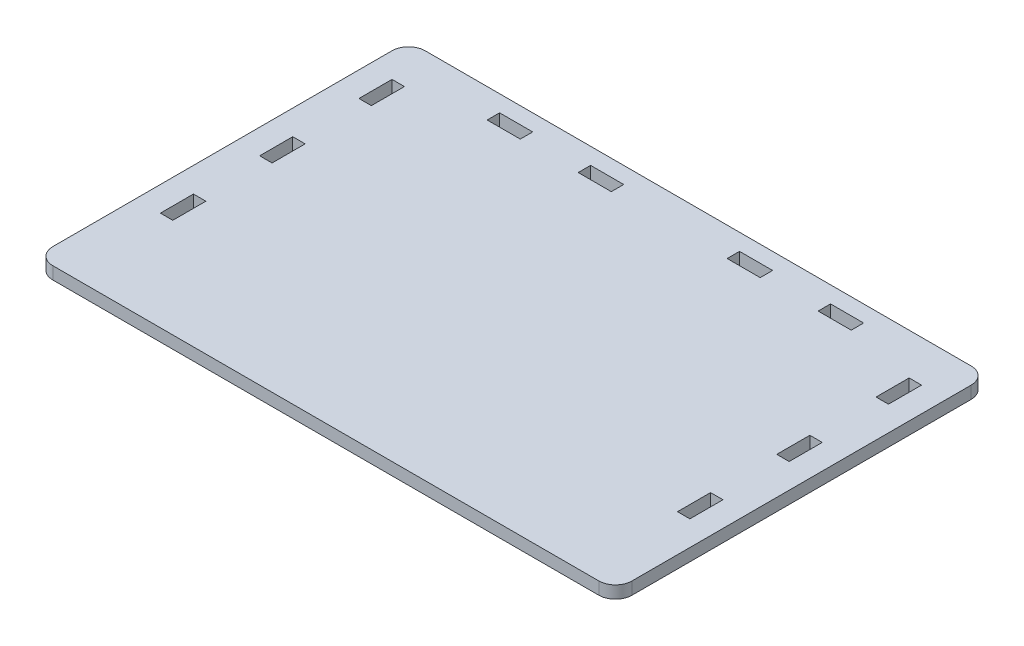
ISO-10303-21;
HEADER;
FILE_DESCRIPTION(('STEP AP214'),'2;1');
FILE_NAME('part.step','',(''),(''),'','','');
FILE_SCHEMA(('AUTOMOTIVE_DESIGN { 1 0 10303 214 1 1 1 1 }'));
ENDSEC;
DATA;
#1=APPLICATION_CONTEXT('core data for automotive mechanical design processes');
#2=APPLICATION_PROTOCOL_DEFINITION('international standard','automotive_design',2000,#1);
#3=PRODUCT_CONTEXT('',#1,'mechanical');
#4=PRODUCT('Part','Part','',(#3));
#5=PRODUCT_RELATED_PRODUCT_CATEGORY('part','',(#4));
#6=PRODUCT_DEFINITION_FORMATION('','',#4);
#7=PRODUCT_DEFINITION_CONTEXT('part definition',#1,'design');
#8=PRODUCT_DEFINITION('design','',#6,#7);
#9=PRODUCT_DEFINITION_SHAPE('','',#8);
#10=(LENGTH_UNIT() NAMED_UNIT(*) SI_UNIT(.MILLI.,.METRE.));
#11=(NAMED_UNIT(*) PLANE_ANGLE_UNIT() SI_UNIT($,.RADIAN.));
#12=(NAMED_UNIT(*) SI_UNIT($,.STERADIAN.) SOLID_ANGLE_UNIT());
#13=UNCERTAINTY_MEASURE_WITH_UNIT(LENGTH_MEASURE(1.E-05),#10,'distance_accuracy_value','');
#14=(GEOMETRIC_REPRESENTATION_CONTEXT(3) GLOBAL_UNCERTAINTY_ASSIGNED_CONTEXT((#13)) GLOBAL_UNIT_ASSIGNED_CONTEXT((#10,
#11,#12)) REPRESENTATION_CONTEXT('',''));
#15=CARTESIAN_POINT('',(0.,0.,0.));
#16=DIRECTION('',(0.,0.,1.));
#17=DIRECTION('',(1.,0.,0.));
#18=AXIS2_PLACEMENT_3D('',#15,#16,#17);
#19=CARTESIAN_POINT('',(0.,15.,0.));
#20=DIRECTION('',(0.,-1.,0.));
#21=DIRECTION('',(0.,0.,-1.));
#22=AXIS2_PLACEMENT_3D('',#19,#20,#21);
#23=PLANE('',#22);
#24=DIRECTION('',(0.,0.,-1.));
#25=VECTOR('',#24,1.);
#26=CARTESIAN_POINT('',(320.,15.,-175.));
#27=LINE('',#26,#25);
#28=CARTESIAN_POINT('',(320.,15.,-135.));
#29=VERTEX_POINT('',#28);
#30=CARTESIAN_POINT('',(320.,15.,-175.));
#31=VERTEX_POINT('',#30);
#32=EDGE_CURVE('E467',#29,#31,#27,.T.);
#33=ORIENTED_EDGE('',*,*,#32,.F.);
#34=DIRECTION('',(1.,0.,0.));
#35=VECTOR('',#34,1.);
#36=CARTESIAN_POINT('',(320.,15.,-135.));
#37=LINE('',#36,#35);
#38=CARTESIAN_POINT('',(305.,15.,-135.));
#39=VERTEX_POINT('',#38);
#40=EDGE_CURVE('E462',#39,#29,#37,.T.);
#41=ORIENTED_EDGE('',*,*,#40,.F.);
#42=DIRECTION('',(0.,0.,1.));
#43=VECTOR('',#42,1.);
#44=CARTESIAN_POINT('',(305.,15.,-175.));
#45=LINE('',#44,#43);
#46=CARTESIAN_POINT('',(305.,15.,-175.));
#47=VERTEX_POINT('',#46);
#48=EDGE_CURVE('E476',#47,#39,#45,.T.);
#49=ORIENTED_EDGE('',*,*,#48,.F.);
#50=DIRECTION('',(-1.,0.,0.));
#51=VECTOR('',#50,1.);
#52=CARTESIAN_POINT('',(320.,15.,-175.));
#53=LINE('',#52,#51);
#54=EDGE_CURVE('E478',#31,#47,#53,.T.);
#55=ORIENTED_EDGE('',*,*,#54,.F.);
#56=EDGE_LOOP('',(#33,#41,#49,#55));
#57=FACE_BOUND('',#56,.T.);
#58=DIRECTION('',(0.,0.,1.));
#59=VECTOR('',#58,1.);
#60=CARTESIAN_POINT('',(-320.,15.,-55.));
#61=LINE('',#60,#59);
#62=CARTESIAN_POINT('',(-320.,15.,-55.));
#63=VERTEX_POINT('',#62);
#64=CARTESIAN_POINT('',(-320.,15.,-15.));
#65=VERTEX_POINT('',#64);
#66=EDGE_CURVE('E404',#63,#65,#61,.T.);
#67=ORIENTED_EDGE('',*,*,#66,.F.);
#68=DIRECTION('',(-1.,0.,0.));
#69=VECTOR('',#68,1.);
#70=CARTESIAN_POINT('',(-320.,15.,-55.));
#71=LINE('',#70,#69);
#72=CARTESIAN_POINT('',(-305.,15.,-55.));
#73=VERTEX_POINT('',#72);
#74=EDGE_CURVE('E399',#73,#63,#71,.T.);
#75=ORIENTED_EDGE('',*,*,#74,.F.);
#76=DIRECTION('',(0.,0.,-1.));
#77=VECTOR('',#76,1.);
#78=CARTESIAN_POINT('',(-305.,15.,-55.));
#79=LINE('',#78,#77);
#80=CARTESIAN_POINT('',(-305.,15.,-15.));
#81=VERTEX_POINT('',#80);
#82=EDGE_CURVE('E415',#81,#73,#79,.T.);
#83=ORIENTED_EDGE('',*,*,#82,.F.);
#84=DIRECTION('',(1.,0.,0.));
#85=VECTOR('',#84,1.);
#86=CARTESIAN_POINT('',(-320.,15.,-15.));
#87=LINE('',#86,#85);
#88=EDGE_CURVE('E418',#65,#81,#87,.T.);
#89=ORIENTED_EDGE('',*,*,#88,.F.);
#90=EDGE_LOOP('',(#67,#75,#83,#89));
#91=FACE_BOUND('',#90,.T.);
#92=DIRECTION('',(0.,0.,1.));
#93=VECTOR('',#92,1.);
#94=CARTESIAN_POINT('',(70.,15.,-205.));
#95=LINE('',#94,#93);
#96=CARTESIAN_POINT('',(70.,15.,-205.));
#97=VERTEX_POINT('',#96);
#98=CARTESIAN_POINT('',(70.,15.,-190.));
#99=VERTEX_POINT('',#98);
#100=EDGE_CURVE('E617',#97,#99,#95,.T.);
#101=ORIENTED_EDGE('',*,*,#100,.F.);
#102=DIRECTION('',(-1.,0.,0.));
#103=VECTOR('',#102,1.);
#104=CARTESIAN_POINT('',(70.,15.,-205.));
#105=LINE('',#104,#103);
#106=CARTESIAN_POINT('',(110.,15.,-205.));
#107=VERTEX_POINT('',#106);
#108=EDGE_CURVE('E612',#107,#97,#105,.T.);
#109=ORIENTED_EDGE('',*,*,#108,.F.);
#110=DIRECTION('',(0.,0.,-1.));
#111=VECTOR('',#110,1.);
#112=CARTESIAN_POINT('',(110.,15.,-205.));
#113=LINE('',#112,#111);
#114=CARTESIAN_POINT('',(110.,15.,-190.));
#115=VERTEX_POINT('',#114);
#116=EDGE_CURVE('E626',#115,#107,#113,.T.);
#117=ORIENTED_EDGE('',*,*,#116,.F.);
#118=DIRECTION('',(1.,0.,0.));
#119=VECTOR('',#118,1.);
#120=CARTESIAN_POINT('',(70.,15.,-190.));
#121=LINE('',#120,#119);
#122=EDGE_CURVE('E629',#99,#115,#121,.T.);
#123=ORIENTED_EDGE('',*,*,#122,.F.);
#124=EDGE_LOOP('',(#101,#109,#117,#123));
#125=FACE_BOUND('',#124,.T.);
#126=DIRECTION('',(0.,0.,1.));
#127=VECTOR('',#126,1.);
#128=CARTESIAN_POINT('',(-320.,15.,-175.));
#129=LINE('',#128,#127);
#130=CARTESIAN_POINT('',(-320.,15.,-175.));
#131=VERTEX_POINT('',#130);
#132=CARTESIAN_POINT('',(-320.,15.,-135.));
#133=VERTEX_POINT('',#132);
#134=EDGE_CURVE('E555',#131,#133,#129,.T.);
#135=ORIENTED_EDGE('',*,*,#134,.F.);
#136=DIRECTION('',(-1.,0.,0.));
#137=VECTOR('',#136,1.);
#138=CARTESIAN_POINT('',(-320.,15.,-175.));
#139=LINE('',#138,#137);
#140=CARTESIAN_POINT('',(-305.,15.,-175.));
#141=VERTEX_POINT('',#140);
#142=EDGE_CURVE('E550',#141,#131,#139,.T.);
#143=ORIENTED_EDGE('',*,*,#142,.F.);
#144=DIRECTION('',(0.,0.,-1.));
#145=VECTOR('',#144,1.);
#146=CARTESIAN_POINT('',(-305.,15.,-175.));
#147=LINE('',#146,#145);
#148=CARTESIAN_POINT('',(-305.,15.,-135.));
#149=VERTEX_POINT('',#148);
#150=EDGE_CURVE('E564',#149,#141,#147,.T.);
#151=ORIENTED_EDGE('',*,*,#150,.F.);
#152=DIRECTION('',(1.,0.,0.));
#153=VECTOR('',#152,1.);
#154=CARTESIAN_POINT('',(-320.,15.,-135.));
#155=LINE('',#154,#153);
#156=EDGE_CURVE('E567',#133,#149,#155,.T.);
#157=ORIENTED_EDGE('',*,*,#156,.F.);
#158=EDGE_LOOP('',(#135,#143,#151,#157));
#159=FACE_BOUND('',#158,.T.);
#160=DIRECTION('',(0.,0.,1.));
#161=VECTOR('',#160,1.);
#162=CARTESIAN_POINT('',(-220.,15.,-205.));
#163=LINE('',#162,#161);
#164=CARTESIAN_POINT('',(-220.,15.,-205.));
#165=VERTEX_POINT('',#164);
#166=CARTESIAN_POINT('',(-220.,15.,-190.));
#167=VERTEX_POINT('',#166);
#168=EDGE_CURVE('E632',#165,#167,#163,.T.);
#169=ORIENTED_EDGE('',*,*,#168,.F.);
#170=DIRECTION('',(-1.,0.,0.));
#171=VECTOR('',#170,1.);
#172=CARTESIAN_POINT('',(-220.,15.,-205.));
#173=LINE('',#172,#171);
#174=CARTESIAN_POINT('',(-180.,15.,-205.));
#175=VERTEX_POINT('',#174);
#176=EDGE_CURVE('E640',#175,#165,#173,.T.);
#177=ORIENTED_EDGE('',*,*,#176,.F.);
#178=DIRECTION('',(0.,0.,-1.));
#179=VECTOR('',#178,1.);
#180=CARTESIAN_POINT('',(-180.,15.,-205.));
#181=LINE('',#180,#179);
#182=CARTESIAN_POINT('',(-180.,15.,-190.));
#183=VERTEX_POINT('',#182);
#184=EDGE_CURVE('E637',#183,#175,#181,.T.);
#185=ORIENTED_EDGE('',*,*,#184,.F.);
#186=DIRECTION('',(1.,0.,0.));
#187=VECTOR('',#186,1.);
#188=CARTESIAN_POINT('',(-220.,15.,-190.));
#189=LINE('',#188,#187);
#190=EDGE_CURVE('E634',#167,#183,#189,.T.);
#191=ORIENTED_EDGE('',*,*,#190,.F.);
#192=EDGE_LOOP('',(#169,#177,#185,#191));
#193=FACE_BOUND('',#192,.T.);
#194=DIRECTION('',(-1.,0.,0.));
#195=VECTOR('',#194,1.);
#196=CARTESIAN_POINT('',(-350.,15.,-225.));
#197=LINE('',#196,#195);
#198=CARTESIAN_POINT('',(330.,15.,-225.));
#199=VERTEX_POINT('',#198);
#200=CARTESIAN_POINT('',(-330.,15.,-225.));
#201=VERTEX_POINT('',#200);
#202=EDGE_CURVE('E666',#199,#201,#197,.T.);
#203=ORIENTED_EDGE('',*,*,#202,.T.);
#204=CARTESIAN_POINT('',(-330.,15.,-205.));
#205=DIRECTION('',(0.,-1.,0.));
#206=DIRECTION('',(0.,0.,-1.));
#207=AXIS2_PLACEMENT_3D('',#204,#205,#206);
#208=CIRCLE('',#207,20.);
#209=CARTESIAN_POINT('',(-350.,15.,-205.));
#210=VERTEX_POINT('',#209);
#211=EDGE_CURVE('E710',#201,#210,#208,.F.);
#212=ORIENTED_EDGE('',*,*,#211,.T.);
#213=DIRECTION('',(0.,0.,1.));
#214=VECTOR('',#213,1.);
#215=CARTESIAN_POINT('',(-350.,15.,225.));
#216=LINE('',#215,#214);
#217=CARTESIAN_POINT('',(-350.,15.,205.));
#218=VERTEX_POINT('',#217);
#219=EDGE_CURVE('E670',#210,#218,#216,.T.);
#220=ORIENTED_EDGE('',*,*,#219,.T.);
#221=CARTESIAN_POINT('',(-330.,15.,205.));
#222=DIRECTION('',(0.,-1.,0.));
#223=DIRECTION('',(0.,0.,-1.));
#224=AXIS2_PLACEMENT_3D('',#221,#222,#223);
#225=CIRCLE('',#224,20.);
#226=CARTESIAN_POINT('',(-330.,15.,225.));
#227=VERTEX_POINT('',#226);
#228=EDGE_CURVE('E704',#218,#227,#225,.F.);
#229=ORIENTED_EDGE('',*,*,#228,.T.);
#230=DIRECTION('',(1.,0.,0.));
#231=VECTOR('',#230,1.);
#232=CARTESIAN_POINT('',(-350.,15.,225.));
#233=LINE('',#232,#231);
#234=CARTESIAN_POINT('',(330.,15.,225.));
#235=VERTEX_POINT('',#234);
#236=EDGE_CURVE('E673',#227,#235,#233,.T.);
#237=ORIENTED_EDGE('',*,*,#236,.T.);
#238=CARTESIAN_POINT('',(330.,15.,205.));
#239=DIRECTION('',(0.,-1.,0.));
#240=DIRECTION('',(0.,0.,-1.));
#241=AXIS2_PLACEMENT_3D('',#238,#239,#240);
#242=CIRCLE('',#241,20.);
#243=CARTESIAN_POINT('',(350.,15.,205.));
#244=VERTEX_POINT('',#243);
#245=EDGE_CURVE('E706',#235,#244,#242,.F.);
#246=ORIENTED_EDGE('',*,*,#245,.T.);
#247=DIRECTION('',(0.,0.,-1.));
#248=VECTOR('',#247,1.);
#249=CARTESIAN_POINT('',(350.,15.,225.));
#250=LINE('',#249,#248);
#251=CARTESIAN_POINT('',(350.,15.,-205.));
#252=VERTEX_POINT('',#251);
#253=EDGE_CURVE('E663',#244,#252,#250,.T.);
#254=ORIENTED_EDGE('',*,*,#253,.T.);
#255=CARTESIAN_POINT('',(330.,15.,-205.));
#256=DIRECTION('',(0.,-1.,0.));
#257=DIRECTION('',(0.,0.,-1.));
#258=AXIS2_PLACEMENT_3D('',#255,#256,#257);
#259=CIRCLE('',#258,20.);
#260=EDGE_CURVE('E708',#252,#199,#259,.F.);
#261=ORIENTED_EDGE('',*,*,#260,.T.);
#262=EDGE_LOOP('',(#203,#212,#220,#229,#237,#246,#254,#261));
#263=FACE_BOUND('',#262,.T.);
#264=DIRECTION('',(-1.,0.,0.));
#265=VECTOR('',#264,1.);
#266=CARTESIAN_POINT('',(320.,15.,-55.0000000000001));
#267=LINE('',#266,#265);
#268=CARTESIAN_POINT('',(320.,15.,-55.0000000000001));
#269=VERTEX_POINT('',#268);
#270=CARTESIAN_POINT('',(305.,15.,-55.0000000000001));
#271=VERTEX_POINT('',#270);
#272=EDGE_CURVE('E370',#269,#271,#267,.T.);
#273=ORIENTED_EDGE('',*,*,#272,.F.);
#274=DIRECTION('',(0.,0.,-1.));
#275=VECTOR('',#274,1.);
#276=CARTESIAN_POINT('',(320.,15.,-55.0000000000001));
#277=LINE('',#276,#275);
#278=CARTESIAN_POINT('',(320.,15.,-15.0000000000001));
#279=VERTEX_POINT('',#278);
#280=EDGE_CURVE('E382',#279,#269,#277,.T.);
#281=ORIENTED_EDGE('',*,*,#280,.F.);
#282=DIRECTION('',(1.,0.,0.));
#283=VECTOR('',#282,1.);
#284=CARTESIAN_POINT('',(320.,15.,-15.0000000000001));
#285=LINE('',#284,#283);
#286=CARTESIAN_POINT('',(305.,15.,-15.0000000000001));
#287=VERTEX_POINT('',#286);
#288=EDGE_CURVE('E357',#287,#279,#285,.T.);
#289=ORIENTED_EDGE('',*,*,#288,.F.);
#290=DIRECTION('',(0.,0.,1.));
#291=VECTOR('',#290,1.);
#292=CARTESIAN_POINT('',(305.,15.,-55.0000000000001));
#293=LINE('',#292,#291);
#294=EDGE_CURVE('E385',#271,#287,#293,.T.);
#295=ORIENTED_EDGE('',*,*,#294,.F.);
#296=EDGE_LOOP('',(#273,#281,#289,#295));
#297=FACE_BOUND('',#296,.T.);
#298=DIRECTION('',(0.,0.,1.));
#299=VECTOR('',#298,1.);
#300=CARTESIAN_POINT('',(180.,15.,-205.));
#301=LINE('',#300,#299);
#302=CARTESIAN_POINT('',(180.,15.,-205.));
#303=VERTEX_POINT('',#302);
#304=CARTESIAN_POINT('',(180.,15.,-190.));
#305=VERTEX_POINT('',#304);
#306=EDGE_CURVE('E524',#303,#305,#301,.T.);
#307=ORIENTED_EDGE('',*,*,#306,.F.);
#308=DIRECTION('',(-1.,0.,0.));
#309=VECTOR('',#308,1.);
#310=CARTESIAN_POINT('',(180.,15.,-205.));
#311=LINE('',#310,#309);
#312=CARTESIAN_POINT('',(220.,15.,-205.));
#313=VERTEX_POINT('',#312);
#314=EDGE_CURVE('E519',#313,#303,#311,.T.);
#315=ORIENTED_EDGE('',*,*,#314,.F.);
#316=DIRECTION('',(0.,0.,-1.));
#317=VECTOR('',#316,1.);
#318=CARTESIAN_POINT('',(220.,15.,-205.));
#319=LINE('',#318,#317);
#320=CARTESIAN_POINT('',(220.,15.,-190.));
#321=VERTEX_POINT('',#320);
#322=EDGE_CURVE('E535',#321,#313,#319,.T.);
#323=ORIENTED_EDGE('',*,*,#322,.F.);
#324=DIRECTION('',(1.,0.,0.));
#325=VECTOR('',#324,1.);
#326=CARTESIAN_POINT('',(180.,15.,-190.));
#327=LINE('',#326,#325);
#328=EDGE_CURVE('E538',#305,#321,#327,.T.);
#329=ORIENTED_EDGE('',*,*,#328,.F.);
#330=EDGE_LOOP('',(#307,#315,#323,#329));
#331=FACE_BOUND('',#330,.T.);
#332=DIRECTION('',(0.,0.,1.));
#333=VECTOR('',#332,1.);
#334=CARTESIAN_POINT('',(-110.,15.,-205.));
#335=LINE('',#334,#333);
#336=CARTESIAN_POINT('',(-110.,15.,-205.));
#337=VERTEX_POINT('',#336);
#338=CARTESIAN_POINT('',(-110.,15.,-190.));
#339=VERTEX_POINT('',#338);
#340=EDGE_CURVE('E586',#337,#339,#335,.T.);
#341=ORIENTED_EDGE('',*,*,#340,.F.);
#342=DIRECTION('',(-1.,0.,0.));
#343=VECTOR('',#342,1.);
#344=CARTESIAN_POINT('',(-110.,15.,-205.));
#345=LINE('',#344,#343);
#346=CARTESIAN_POINT('',(-70.,15.,-205.));
#347=VERTEX_POINT('',#346);
#348=EDGE_CURVE('E581',#347,#337,#345,.T.);
#349=ORIENTED_EDGE('',*,*,#348,.F.);
#350=DIRECTION('',(0.,0.,-1.));
#351=VECTOR('',#350,1.);
#352=CARTESIAN_POINT('',(-70.,15.,-205.));
#353=LINE('',#352,#351);
#354=CARTESIAN_POINT('',(-70.,15.,-190.));
#355=VERTEX_POINT('',#354);
#356=EDGE_CURVE('E597',#355,#347,#353,.T.);
#357=ORIENTED_EDGE('',*,*,#356,.F.);
#358=DIRECTION('',(1.,0.,0.));
#359=VECTOR('',#358,1.);
#360=CARTESIAN_POINT('',(-110.,15.,-190.));
#361=LINE('',#360,#359);
#362=EDGE_CURVE('E600',#339,#355,#361,.T.);
#363=ORIENTED_EDGE('',*,*,#362,.F.);
#364=EDGE_LOOP('',(#341,#349,#357,#363));
#365=FACE_BOUND('',#364,.T.);
#366=DIRECTION('',(0.,0.,1.));
#367=VECTOR('',#366,1.);
#368=CARTESIAN_POINT('',(-320.,15.,65.));
#369=LINE('',#368,#367);
#370=CARTESIAN_POINT('',(-320.,15.,65.));
#371=VERTEX_POINT('',#370);
#372=CARTESIAN_POINT('',(-320.,15.,105.));
#373=VERTEX_POINT('',#372);
#374=EDGE_CURVE('E437',#371,#373,#369,.T.);
#375=ORIENTED_EDGE('',*,*,#374,.F.);
#376=DIRECTION('',(-1.,0.,0.));
#377=VECTOR('',#376,1.);
#378=CARTESIAN_POINT('',(-320.,15.,65.));
#379=LINE('',#378,#377);
#380=CARTESIAN_POINT('',(-305.,15.,65.));
#381=VERTEX_POINT('',#380);
#382=EDGE_CURVE('E432',#381,#371,#379,.T.);
#383=ORIENTED_EDGE('',*,*,#382,.F.);
#384=DIRECTION('',(0.,0.,-1.));
#385=VECTOR('',#384,1.);
#386=CARTESIAN_POINT('',(-305.,15.,65.));
#387=LINE('',#386,#385);
#388=CARTESIAN_POINT('',(-305.,15.,105.));
#389=VERTEX_POINT('',#388);
#390=EDGE_CURVE('E446',#389,#381,#387,.T.);
#391=ORIENTED_EDGE('',*,*,#390,.F.);
#392=DIRECTION('',(1.,0.,0.));
#393=VECTOR('',#392,1.);
#394=CARTESIAN_POINT('',(-320.,15.,105.));
#395=LINE('',#394,#393);
#396=EDGE_CURVE('E449',#373,#389,#395,.T.);
#397=ORIENTED_EDGE('',*,*,#396,.F.);
#398=EDGE_LOOP('',(#375,#383,#391,#397));
#399=FACE_BOUND('',#398,.T.);
#400=DIRECTION('',(0.,0.,-1.));
#401=VECTOR('',#400,1.);
#402=CARTESIAN_POINT('',(320.,15.,64.9999999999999));
#403=LINE('',#402,#401);
#404=CARTESIAN_POINT('',(320.,15.,105.));
#405=VERTEX_POINT('',#404);
#406=CARTESIAN_POINT('',(320.,15.,64.9999999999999));
#407=VERTEX_POINT('',#406);
#408=EDGE_CURVE('E494',#405,#407,#403,.T.);
#409=ORIENTED_EDGE('',*,*,#408,.F.);
#410=DIRECTION('',(1.,0.,0.));
#411=VECTOR('',#410,1.);
#412=CARTESIAN_POINT('',(320.,15.,105.));
#413=LINE('',#412,#411);
#414=CARTESIAN_POINT('',(305.,15.,105.));
#415=VERTEX_POINT('',#414);
#416=EDGE_CURVE('E489',#415,#405,#413,.T.);
#417=ORIENTED_EDGE('',*,*,#416,.F.);
#418=DIRECTION('',(0.,0.,1.));
#419=VECTOR('',#418,1.);
#420=CARTESIAN_POINT('',(305.,15.,64.9999999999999));
#421=LINE('',#420,#419);
#422=CARTESIAN_POINT('',(305.,15.,64.9999999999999));
#423=VERTEX_POINT('',#422);
#424=EDGE_CURVE('E503',#423,#415,#421,.T.);
#425=ORIENTED_EDGE('',*,*,#424,.F.);
#426=DIRECTION('',(-1.,0.,0.));
#427=VECTOR('',#426,1.);
#428=CARTESIAN_POINT('',(320.,15.,64.9999999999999));
#429=LINE('',#428,#427);
#430=EDGE_CURVE('E505',#407,#423,#429,.T.);
#431=ORIENTED_EDGE('',*,*,#430,.F.);
#432=EDGE_LOOP('',(#409,#417,#425,#431));
#433=FACE_BOUND('',#432,.T.);
#434=ADVANCED_FACE('F45',(#57,#91,#125,#159,#193,#263,#297,#331,#365,#399,#433),#23,.F.);
#435=CARTESIAN_POINT('',(0.,0.,0.));
#436=DIRECTION('',(0.,-1.,0.));
#437=DIRECTION('',(0.,0.,-1.));
#438=AXIS2_PLACEMENT_3D('',#435,#436,#437);
#439=PLANE('',#438);
#440=DIRECTION('',(0.,0.,1.));
#441=VECTOR('',#440,1.);
#442=CARTESIAN_POINT('',(-350.,0.,225.));
#443=LINE('',#442,#441);
#444=CARTESIAN_POINT('',(-350.,0.,-205.));
#445=VERTEX_POINT('',#444);
#446=CARTESIAN_POINT('',(-350.,0.,205.));
#447=VERTEX_POINT('',#446);
#448=EDGE_CURVE('E682',#445,#447,#443,.T.);
#449=ORIENTED_EDGE('',*,*,#448,.F.);
#450=CARTESIAN_POINT('',(-330.,0.,-205.));
#451=DIRECTION('',(0.,-1.,0.));
#452=DIRECTION('',(0.,0.,-1.));
#453=AXIS2_PLACEMENT_3D('',#450,#451,#452);
#454=CIRCLE('',#453,20.);
#455=CARTESIAN_POINT('',(-330.,0.,-225.));
#456=VERTEX_POINT('',#455);
#457=EDGE_CURVE('E697',#445,#456,#454,.T.);
#458=ORIENTED_EDGE('',*,*,#457,.T.);
#459=DIRECTION('',(-1.,0.,0.));
#460=VECTOR('',#459,1.);
#461=CARTESIAN_POINT('',(-350.,0.,-225.));
#462=LINE('',#461,#460);
#463=CARTESIAN_POINT('',(330.,0.,-225.));
#464=VERTEX_POINT('',#463);
#465=EDGE_CURVE('E679',#464,#456,#462,.T.);
#466=ORIENTED_EDGE('',*,*,#465,.F.);
#467=CARTESIAN_POINT('',(330.,0.,-205.));
#468=DIRECTION('',(0.,-1.,0.));
#469=DIRECTION('',(0.,0.,-1.));
#470=AXIS2_PLACEMENT_3D('',#467,#468,#469);
#471=CIRCLE('',#470,20.);
#472=CARTESIAN_POINT('',(350.,0.,-205.));
#473=VERTEX_POINT('',#472);
#474=EDGE_CURVE('E695',#464,#473,#471,.T.);
#475=ORIENTED_EDGE('',*,*,#474,.T.);
#476=DIRECTION('',(0.,0.,-1.));
#477=VECTOR('',#476,1.);
#478=CARTESIAN_POINT('',(350.,0.,225.));
#479=LINE('',#478,#477);
#480=CARTESIAN_POINT('',(350.,0.,205.));
#481=VERTEX_POINT('',#480);
#482=EDGE_CURVE('E662',#481,#473,#479,.T.);
#483=ORIENTED_EDGE('',*,*,#482,.F.);
#484=CARTESIAN_POINT('',(330.,0.,205.));
#485=DIRECTION('',(0.,-1.,0.));
#486=DIRECTION('',(0.,0.,-1.));
#487=AXIS2_PLACEMENT_3D('',#484,#485,#486);
#488=CIRCLE('',#487,20.);
#489=CARTESIAN_POINT('',(330.,0.,225.));
#490=VERTEX_POINT('',#489);
#491=EDGE_CURVE('E693',#481,#490,#488,.T.);
#492=ORIENTED_EDGE('',*,*,#491,.T.);
#493=DIRECTION('',(1.,0.,0.));
#494=VECTOR('',#493,1.);
#495=CARTESIAN_POINT('',(-350.,0.,225.));
#496=LINE('',#495,#494);
#497=CARTESIAN_POINT('',(-330.,0.,225.));
#498=VERTEX_POINT('',#497);
#499=EDGE_CURVE('E667',#498,#490,#496,.T.);
#500=ORIENTED_EDGE('',*,*,#499,.F.);
#501=CARTESIAN_POINT('',(-330.,0.,205.));
#502=DIRECTION('',(0.,-1.,0.));
#503=DIRECTION('',(0.,0.,-1.));
#504=AXIS2_PLACEMENT_3D('',#501,#502,#503);
#505=CIRCLE('',#504,20.);
#506=EDGE_CURVE('E691',#498,#447,#505,.T.);
#507=ORIENTED_EDGE('',*,*,#506,.T.);
#508=EDGE_LOOP('',(#449,#458,#466,#475,#483,#492,#500,#507));
#509=FACE_BOUND('',#508,.T.);
#510=DIRECTION('',(-1.,0.,0.));
#511=VECTOR('',#510,1.);
#512=CARTESIAN_POINT('',(-220.,0.,-205.));
#513=LINE('',#512,#511);
#514=CARTESIAN_POINT('',(-180.,0.,-205.));
#515=VERTEX_POINT('',#514);
#516=CARTESIAN_POINT('',(-220.,0.,-205.));
#517=VERTEX_POINT('',#516);
#518=EDGE_CURVE('E635',#515,#517,#513,.T.);
#519=ORIENTED_EDGE('',*,*,#518,.T.);
#520=DIRECTION('',(0.,0.,1.));
#521=VECTOR('',#520,1.);
#522=CARTESIAN_POINT('',(-220.,0.,-205.));
#523=LINE('',#522,#521);
#524=CARTESIAN_POINT('',(-220.,0.,-190.));
#525=VERTEX_POINT('',#524);
#526=EDGE_CURVE('E595',#517,#525,#523,.T.);
#527=ORIENTED_EDGE('',*,*,#526,.T.);
#528=DIRECTION('',(1.,0.,0.));
#529=VECTOR('',#528,1.);
#530=CARTESIAN_POINT('',(-220.,0.,-190.));
#531=LINE('',#530,#529);
#532=CARTESIAN_POINT('',(-180.,0.,-190.));
#533=VERTEX_POINT('',#532);
#534=EDGE_CURVE('E645',#525,#533,#531,.T.);
#535=ORIENTED_EDGE('',*,*,#534,.T.);
#536=DIRECTION('',(0.,0.,-1.));
#537=VECTOR('',#536,1.);
#538=CARTESIAN_POINT('',(-180.,0.,-205.));
#539=LINE('',#538,#537);
#540=EDGE_CURVE('E648',#533,#515,#539,.T.);
#541=ORIENTED_EDGE('',*,*,#540,.T.);
#542=EDGE_LOOP('',(#519,#527,#535,#541));
#543=FACE_BOUND('',#542,.T.);
#544=DIRECTION('',(0.,0.,-1.));
#545=VECTOR('',#544,1.);
#546=CARTESIAN_POINT('',(320.,0.,-55.0000000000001));
#547=LINE('',#546,#545);
#548=CARTESIAN_POINT('',(320.,0.,-15.0000000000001));
#549=VERTEX_POINT('',#548);
#550=CARTESIAN_POINT('',(320.,0.,-55.0000000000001));
#551=VERTEX_POINT('',#550);
#552=EDGE_CURVE('E365',#549,#551,#547,.T.);
#553=ORIENTED_EDGE('',*,*,#552,.T.);
#554=DIRECTION('',(-1.,0.,0.));
#555=VECTOR('',#554,1.);
#556=CARTESIAN_POINT('',(320.,0.,-55.0000000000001));
#557=LINE('',#556,#555);
#558=CARTESIAN_POINT('',(305.,0.,-55.0000000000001));
#559=VERTEX_POINT('',#558);
#560=EDGE_CURVE('E376',#551,#559,#557,.T.);
#561=ORIENTED_EDGE('',*,*,#560,.T.);
#562=DIRECTION('',(0.,0.,1.));
#563=VECTOR('',#562,1.);
#564=CARTESIAN_POINT('',(305.,0.,-55.0000000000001));
#565=LINE('',#564,#563);
#566=CARTESIAN_POINT('',(305.,0.,-15.0000000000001));
#567=VERTEX_POINT('',#566);
#568=EDGE_CURVE('E374',#559,#567,#565,.T.);
#569=ORIENTED_EDGE('',*,*,#568,.T.);
#570=DIRECTION('',(1.,0.,0.));
#571=VECTOR('',#570,1.);
#572=CARTESIAN_POINT('',(320.,0.,-15.0000000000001));
#573=LINE('',#572,#571);
#574=EDGE_CURVE('E354',#567,#549,#573,.T.);
#575=ORIENTED_EDGE('',*,*,#574,.T.);
#576=EDGE_LOOP('',(#553,#561,#569,#575));
#577=FACE_BOUND('',#576,.T.);
#578=DIRECTION('',(-1.,0.,0.));
#579=VECTOR('',#578,1.);
#580=CARTESIAN_POINT('',(-320.,0.,-175.));
#581=LINE('',#580,#579);
#582=CARTESIAN_POINT('',(-305.,0.,-175.));
#583=VERTEX_POINT('',#582);
#584=CARTESIAN_POINT('',(-320.,0.,-175.));
#585=VERTEX_POINT('',#584);
#586=EDGE_CURVE('E551',#583,#585,#581,.T.);
#587=ORIENTED_EDGE('',*,*,#586,.T.);
#588=DIRECTION('',(0.,0.,1.));
#589=VECTOR('',#588,1.);
#590=CARTESIAN_POINT('',(-320.,0.,-175.));
#591=LINE('',#590,#589);
#592=CARTESIAN_POINT('',(-320.,0.,-135.));
#593=VERTEX_POINT('',#592);
#594=EDGE_CURVE('E512',#585,#593,#591,.T.);
#595=ORIENTED_EDGE('',*,*,#594,.T.);
#596=DIRECTION('',(1.,0.,0.));
#597=VECTOR('',#596,1.);
#598=CARTESIAN_POINT('',(-320.,0.,-135.));
#599=LINE('',#598,#597);
#600=CARTESIAN_POINT('',(-305.,0.,-135.));
#601=VERTEX_POINT('',#600);
#602=EDGE_CURVE('E558',#593,#601,#599,.T.);
#603=ORIENTED_EDGE('',*,*,#602,.T.);
#604=DIRECTION('',(0.,0.,-1.));
#605=VECTOR('',#604,1.);
#606=CARTESIAN_POINT('',(-305.,0.,-175.));
#607=LINE('',#606,#605);
#608=EDGE_CURVE('E554',#601,#583,#607,.T.);
#609=ORIENTED_EDGE('',*,*,#608,.T.);
#610=EDGE_LOOP('',(#587,#595,#603,#609));
#611=FACE_BOUND('',#610,.T.);
#612=DIRECTION('',(-1.,0.,0.));
#613=VECTOR('',#612,1.);
#614=CARTESIAN_POINT('',(180.,0.,-205.));
#615=LINE('',#614,#613);
#616=CARTESIAN_POINT('',(220.,0.,-205.));
#617=VERTEX_POINT('',#616);
#618=CARTESIAN_POINT('',(180.,0.,-205.));
#619=VERTEX_POINT('',#618);
#620=EDGE_CURVE('E520',#617,#619,#615,.T.);
#621=ORIENTED_EDGE('',*,*,#620,.T.);
#622=DIRECTION('',(0.,0.,1.));
#623=VECTOR('',#622,1.);
#624=CARTESIAN_POINT('',(180.,0.,-205.));
#625=LINE('',#624,#623);
#626=CARTESIAN_POINT('',(180.,0.,-190.));
#627=VERTEX_POINT('',#626);
#628=EDGE_CURVE('E530',#619,#627,#625,.T.);
#629=ORIENTED_EDGE('',*,*,#628,.T.);
#630=DIRECTION('',(1.,0.,0.));
#631=VECTOR('',#630,1.);
#632=CARTESIAN_POINT('',(180.,0.,-190.));
#633=LINE('',#632,#631);
#634=CARTESIAN_POINT('',(220.,0.,-190.));
#635=VERTEX_POINT('',#634);
#636=EDGE_CURVE('E527',#627,#635,#633,.T.);
#637=ORIENTED_EDGE('',*,*,#636,.T.);
#638=DIRECTION('',(0.,0.,-1.));
#639=VECTOR('',#638,1.);
#640=CARTESIAN_POINT('',(220.,0.,-205.));
#641=LINE('',#640,#639);
#642=EDGE_CURVE('E523',#635,#617,#641,.T.);
#643=ORIENTED_EDGE('',*,*,#642,.T.);
#644=EDGE_LOOP('',(#621,#629,#637,#643));
#645=FACE_BOUND('',#644,.T.);
#646=DIRECTION('',(-1.,0.,0.));
#647=VECTOR('',#646,1.);
#648=CARTESIAN_POINT('',(70.,0.,-205.));
#649=LINE('',#648,#647);
#650=CARTESIAN_POINT('',(110.,0.,-205.));
#651=VERTEX_POINT('',#650);
#652=CARTESIAN_POINT('',(70.,0.,-205.));
#653=VERTEX_POINT('',#652);
#654=EDGE_CURVE('E613',#651,#653,#649,.T.);
#655=ORIENTED_EDGE('',*,*,#654,.T.);
#656=DIRECTION('',(0.,0.,1.));
#657=VECTOR('',#656,1.);
#658=CARTESIAN_POINT('',(70.,0.,-205.));
#659=LINE('',#658,#657);
#660=CARTESIAN_POINT('',(70.,0.,-190.));
#661=VERTEX_POINT('',#660);
#662=EDGE_CURVE('E574',#653,#661,#659,.T.);
#663=ORIENTED_EDGE('',*,*,#662,.T.);
#664=DIRECTION('',(1.,0.,0.));
#665=VECTOR('',#664,1.);
#666=CARTESIAN_POINT('',(70.,0.,-190.));
#667=LINE('',#666,#665);
#668=CARTESIAN_POINT('',(110.,0.,-190.));
#669=VERTEX_POINT('',#668);
#670=EDGE_CURVE('E620',#661,#669,#667,.T.);
#671=ORIENTED_EDGE('',*,*,#670,.T.);
#672=DIRECTION('',(0.,0.,-1.));
#673=VECTOR('',#672,1.);
#674=CARTESIAN_POINT('',(110.,0.,-205.));
#675=LINE('',#674,#673);
#676=EDGE_CURVE('E616',#669,#651,#675,.T.);
#677=ORIENTED_EDGE('',*,*,#676,.T.);
#678=EDGE_LOOP('',(#655,#663,#671,#677));
#679=FACE_BOUND('',#678,.T.);
#680=DIRECTION('',(-1.,0.,0.));
#681=VECTOR('',#680,1.);
#682=CARTESIAN_POINT('',(-110.,0.,-205.));
#683=LINE('',#682,#681);
#684=CARTESIAN_POINT('',(-70.,0.,-205.));
#685=VERTEX_POINT('',#684);
#686=CARTESIAN_POINT('',(-110.,0.,-205.));
#687=VERTEX_POINT('',#686);
#688=EDGE_CURVE('E582',#685,#687,#683,.T.);
#689=ORIENTED_EDGE('',*,*,#688,.T.);
#690=DIRECTION('',(0.,0.,1.));
#691=VECTOR('',#690,1.);
#692=CARTESIAN_POINT('',(-110.,0.,-205.));
#693=LINE('',#692,#691);
#694=CARTESIAN_POINT('',(-110.,0.,-190.));
#695=VERTEX_POINT('',#694);
#696=EDGE_CURVE('E592',#687,#695,#693,.T.);
#697=ORIENTED_EDGE('',*,*,#696,.T.);
#698=DIRECTION('',(1.,0.,0.));
#699=VECTOR('',#698,1.);
#700=CARTESIAN_POINT('',(-110.,0.,-190.));
#701=LINE('',#700,#699);
#702=CARTESIAN_POINT('',(-70.,0.,-190.));
#703=VERTEX_POINT('',#702);
#704=EDGE_CURVE('E589',#695,#703,#701,.T.);
#705=ORIENTED_EDGE('',*,*,#704,.T.);
#706=DIRECTION('',(0.,0.,-1.));
#707=VECTOR('',#706,1.);
#708=CARTESIAN_POINT('',(-70.,0.,-205.));
#709=LINE('',#708,#707);
#710=EDGE_CURVE('E585',#703,#685,#709,.T.);
#711=ORIENTED_EDGE('',*,*,#710,.T.);
#712=EDGE_LOOP('',(#689,#697,#705,#711));
#713=FACE_BOUND('',#712,.T.);
#714=DIRECTION('',(-1.,0.,0.));
#715=VECTOR('',#714,1.);
#716=CARTESIAN_POINT('',(-320.,0.,-55.));
#717=LINE('',#716,#715);
#718=CARTESIAN_POINT('',(-305.,0.,-55.));
#719=VERTEX_POINT('',#718);
#720=CARTESIAN_POINT('',(-320.,0.,-55.));
#721=VERTEX_POINT('',#720);
#722=EDGE_CURVE('E400',#719,#721,#717,.T.);
#723=ORIENTED_EDGE('',*,*,#722,.T.);
#724=DIRECTION('',(0.,0.,1.));
#725=VECTOR('',#724,1.);
#726=CARTESIAN_POINT('',(-320.,0.,-55.));
#727=LINE('',#726,#725);
#728=CARTESIAN_POINT('',(-320.,0.,-15.));
#729=VERTEX_POINT('',#728);
#730=EDGE_CURVE('E410',#721,#729,#727,.T.);
#731=ORIENTED_EDGE('',*,*,#730,.T.);
#732=DIRECTION('',(1.,0.,0.));
#733=VECTOR('',#732,1.);
#734=CARTESIAN_POINT('',(-320.,0.,-15.));
#735=LINE('',#734,#733);
#736=CARTESIAN_POINT('',(-305.,0.,-15.));
#737=VERTEX_POINT('',#736);
#738=EDGE_CURVE('E407',#729,#737,#735,.T.);
#739=ORIENTED_EDGE('',*,*,#738,.T.);
#740=DIRECTION('',(0.,0.,-1.));
#741=VECTOR('',#740,1.);
#742=CARTESIAN_POINT('',(-305.,0.,-55.));
#743=LINE('',#742,#741);
#744=EDGE_CURVE('E403',#737,#719,#743,.T.);
#745=ORIENTED_EDGE('',*,*,#744,.T.);
#746=EDGE_LOOP('',(#723,#731,#739,#745));
#747=FACE_BOUND('',#746,.T.);
#748=DIRECTION('',(-1.,0.,0.));
#749=VECTOR('',#748,1.);
#750=CARTESIAN_POINT('',(-320.,0.,65.));
#751=LINE('',#750,#749);
#752=CARTESIAN_POINT('',(-305.,0.,65.));
#753=VERTEX_POINT('',#752);
#754=CARTESIAN_POINT('',(-320.,0.,65.));
#755=VERTEX_POINT('',#754);
#756=EDGE_CURVE('E433',#753,#755,#751,.T.);
#757=ORIENTED_EDGE('',*,*,#756,.T.);
#758=DIRECTION('',(0.,0.,1.));
#759=VECTOR('',#758,1.);
#760=CARTESIAN_POINT('',(-320.,0.,65.));
#761=LINE('',#760,#759);
#762=CARTESIAN_POINT('',(-320.,0.,105.));
#763=VERTEX_POINT('',#762);
#764=EDGE_CURVE('E392',#755,#763,#761,.T.);
#765=ORIENTED_EDGE('',*,*,#764,.T.);
#766=DIRECTION('',(1.,0.,0.));
#767=VECTOR('',#766,1.);
#768=CARTESIAN_POINT('',(-320.,0.,105.));
#769=LINE('',#768,#767);
#770=CARTESIAN_POINT('',(-305.,0.,105.));
#771=VERTEX_POINT('',#770);
#772=EDGE_CURVE('E440',#763,#771,#769,.T.);
#773=ORIENTED_EDGE('',*,*,#772,.T.);
#774=DIRECTION('',(0.,0.,-1.));
#775=VECTOR('',#774,1.);
#776=CARTESIAN_POINT('',(-305.,0.,65.));
#777=LINE('',#776,#775);
#778=EDGE_CURVE('E436',#771,#753,#777,.T.);
#779=ORIENTED_EDGE('',*,*,#778,.T.);
#780=EDGE_LOOP('',(#757,#765,#773,#779));
#781=FACE_BOUND('',#780,.T.);
#782=DIRECTION('',(1.,0.,0.));
#783=VECTOR('',#782,1.);
#784=CARTESIAN_POINT('',(320.,0.,-135.));
#785=LINE('',#784,#783);
#786=CARTESIAN_POINT('',(305.,0.,-135.));
#787=VERTEX_POINT('',#786);
#788=CARTESIAN_POINT('',(320.,0.,-135.));
#789=VERTEX_POINT('',#788);
#790=EDGE_CURVE('E463',#787,#789,#785,.T.);
#791=ORIENTED_EDGE('',*,*,#790,.T.);
#792=DIRECTION('',(0.,0.,-1.));
#793=VECTOR('',#792,1.);
#794=CARTESIAN_POINT('',(320.,0.,-175.));
#795=LINE('',#794,#793);
#796=CARTESIAN_POINT('',(320.,0.,-175.));
#797=VERTEX_POINT('',#796);
#798=EDGE_CURVE('E425',#789,#797,#795,.T.);
#799=ORIENTED_EDGE('',*,*,#798,.T.);
#800=DIRECTION('',(-1.,0.,0.));
#801=VECTOR('',#800,1.);
#802=CARTESIAN_POINT('',(320.,0.,-175.));
#803=LINE('',#802,#801);
#804=CARTESIAN_POINT('',(305.,0.,-175.));
#805=VERTEX_POINT('',#804);
#806=EDGE_CURVE('E470',#797,#805,#803,.T.);
#807=ORIENTED_EDGE('',*,*,#806,.T.);
#808=DIRECTION('',(0.,0.,1.));
#809=VECTOR('',#808,1.);
#810=CARTESIAN_POINT('',(305.,0.,-175.));
#811=LINE('',#810,#809);
#812=EDGE_CURVE('E466',#805,#787,#811,.T.);
#813=ORIENTED_EDGE('',*,*,#812,.T.);
#814=EDGE_LOOP('',(#791,#799,#807,#813));
#815=FACE_BOUND('',#814,.T.);
#816=DIRECTION('',(1.,0.,0.));
#817=VECTOR('',#816,1.);
#818=CARTESIAN_POINT('',(320.,0.,105.));
#819=LINE('',#818,#817);
#820=CARTESIAN_POINT('',(305.,0.,105.));
#821=VERTEX_POINT('',#820);
#822=CARTESIAN_POINT('',(320.,0.,105.));
#823=VERTEX_POINT('',#822);
#824=EDGE_CURVE('E490',#821,#823,#819,.T.);
#825=ORIENTED_EDGE('',*,*,#824,.T.);
#826=DIRECTION('',(0.,0.,-1.));
#827=VECTOR('',#826,1.);
#828=CARTESIAN_POINT('',(320.,0.,64.9999999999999));
#829=LINE('',#828,#827);
#830=CARTESIAN_POINT('',(320.,0.,64.9999999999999));
#831=VERTEX_POINT('',#830);
#832=EDGE_CURVE('E456',#823,#831,#829,.T.);
#833=ORIENTED_EDGE('',*,*,#832,.T.);
#834=DIRECTION('',(-1.,0.,0.));
#835=VECTOR('',#834,1.);
#836=CARTESIAN_POINT('',(320.,0.,64.9999999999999));
#837=LINE('',#836,#835);
#838=CARTESIAN_POINT('',(305.,0.,64.9999999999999));
#839=VERTEX_POINT('',#838);
#840=EDGE_CURVE('E497',#831,#839,#837,.T.);
#841=ORIENTED_EDGE('',*,*,#840,.T.);
#842=DIRECTION('',(0.,0.,1.));
#843=VECTOR('',#842,1.);
#844=CARTESIAN_POINT('',(305.,0.,64.9999999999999));
#845=LINE('',#844,#843);
#846=EDGE_CURVE('E493',#839,#821,#845,.T.);
#847=ORIENTED_EDGE('',*,*,#846,.T.);
#848=EDGE_LOOP('',(#825,#833,#841,#847));
#849=FACE_BOUND('',#848,.T.);
#850=ADVANCED_FACE('F372',(#509,#543,#577,#611,#645,#679,#713,#747,#781,#815,#849),#439,.T.);
#851=CARTESIAN_POINT('',(350.,15.,225.));
#852=DIRECTION('',(-1.,0.,0.));
#853=DIRECTION('',(0.,0.,1.));
#854=AXIS2_PLACEMENT_3D('',#851,#852,#853);
#855=PLANE('',#854);
#856=ORIENTED_EDGE('',*,*,#482,.T.);
#857=DIRECTION('',(0.,-1.,0.));
#858=VECTOR('',#857,1.);
#859=CARTESIAN_POINT('',(350.,15.,-205.));
#860=LINE('',#859,#858);
#861=EDGE_CURVE('E715',#473,#252,#860,.F.);
#862=ORIENTED_EDGE('',*,*,#861,.T.);
#863=ORIENTED_EDGE('',*,*,#253,.F.);
#864=DIRECTION('',(0.,-1.,0.));
#865=VECTOR('',#864,1.);
#866=CARTESIAN_POINT('',(350.,15.,205.));
#867=LINE('',#866,#865);
#868=EDGE_CURVE('E712',#244,#481,#867,.T.);
#869=ORIENTED_EDGE('',*,*,#868,.T.);
#870=EDGE_LOOP('',(#856,#862,#863,#869));
#871=FACE_BOUND('',#870,.T.);
#872=ADVANCED_FACE('F735',(#871),#855,.F.);
#873=CARTESIAN_POINT('',(-350.,15.,-225.));
#874=DIRECTION('',(0.,0.,1.));
#875=DIRECTION('',(1.,0.,0.));
#876=AXIS2_PLACEMENT_3D('',#873,#874,#875);
#877=PLANE('',#876);
#878=ORIENTED_EDGE('',*,*,#465,.T.);
#879=DIRECTION('',(0.,-1.,0.));
#880=VECTOR('',#879,1.);
#881=CARTESIAN_POINT('',(-330.,15.,-225.));
#882=LINE('',#881,#880);
#883=EDGE_CURVE('E702',#456,#201,#882,.F.);
#884=ORIENTED_EDGE('',*,*,#883,.T.);
#885=ORIENTED_EDGE('',*,*,#202,.F.);
#886=DIRECTION('',(0.,-1.,0.));
#887=VECTOR('',#886,1.);
#888=CARTESIAN_POINT('',(330.,15.,-225.));
#889=LINE('',#888,#887);
#890=EDGE_CURVE('E699',#199,#464,#889,.T.);
#891=ORIENTED_EDGE('',*,*,#890,.T.);
#892=EDGE_LOOP('',(#878,#884,#885,#891));
#893=FACE_BOUND('',#892,.T.);
#894=ADVANCED_FACE('F746',(#893),#877,.F.);
#895=CARTESIAN_POINT('',(-350.,15.,225.));
#896=DIRECTION('',(1.,0.,0.));
#897=DIRECTION('',(0.,0.,-1.));
#898=AXIS2_PLACEMENT_3D('',#895,#896,#897);
#899=PLANE('',#898);
#900=ORIENTED_EDGE('',*,*,#219,.F.);
#901=DIRECTION('',(0.,-1.,0.));
#902=VECTOR('',#901,1.);
#903=CARTESIAN_POINT('',(-350.,15.,-205.));
#904=LINE('',#903,#902);
#905=EDGE_CURVE('E688',#210,#445,#904,.T.);
#906=ORIENTED_EDGE('',*,*,#905,.T.);
#907=ORIENTED_EDGE('',*,*,#448,.T.);
#908=DIRECTION('',(0.,-1.,0.));
#909=VECTOR('',#908,1.);
#910=CARTESIAN_POINT('',(-350.,15.,205.));
#911=LINE('',#910,#909);
#912=EDGE_CURVE('E676',#447,#218,#911,.F.);
#913=ORIENTED_EDGE('',*,*,#912,.T.);
#914=EDGE_LOOP('',(#900,#906,#907,#913));
#915=FACE_BOUND('',#914,.T.);
#916=ADVANCED_FACE('F754',(#915),#899,.F.);
#917=CARTESIAN_POINT('',(-350.,15.,225.));
#918=DIRECTION('',(0.,0.,-1.));
#919=DIRECTION('',(-1.,0.,0.));
#920=AXIS2_PLACEMENT_3D('',#917,#918,#919);
#921=PLANE('',#920);
#922=ORIENTED_EDGE('',*,*,#499,.T.);
#923=DIRECTION('',(0.,-1.,0.));
#924=VECTOR('',#923,1.);
#925=CARTESIAN_POINT('',(330.,15.,225.));
#926=LINE('',#925,#924);
#927=EDGE_CURVE('E11',#490,#235,#926,.F.);
#928=ORIENTED_EDGE('',*,*,#927,.T.);
#929=ORIENTED_EDGE('',*,*,#236,.F.);
#930=DIRECTION('',(0.,-1.,0.));
#931=VECTOR('',#930,1.);
#932=CARTESIAN_POINT('',(-330.,15.,225.));
#933=LINE('',#932,#931);
#934=EDGE_CURVE('E53',#227,#498,#933,.T.);
#935=ORIENTED_EDGE('',*,*,#934,.T.);
#936=EDGE_LOOP('',(#922,#928,#929,#935));
#937=FACE_BOUND('',#936,.T.);
#938=ADVANCED_FACE('F721',(#937),#921,.F.);
#939=CARTESIAN_POINT('',(-330.,15.,-205.));
#940=DIRECTION('',(0.,-1.,0.));
#941=DIRECTION('',(0.,0.,-1.));
#942=AXIS2_PLACEMENT_3D('',#939,#940,#941);
#943=CYLINDRICAL_SURFACE('',#942,20.);
#944=ORIENTED_EDGE('',*,*,#211,.F.);
#945=ORIENTED_EDGE('',*,*,#883,.F.);
#946=ORIENTED_EDGE('',*,*,#457,.F.);
#947=ORIENTED_EDGE('',*,*,#905,.F.);
#948=EDGE_LOOP('',(#944,#945,#946,#947));
#949=FACE_BOUND('',#948,.T.);
#950=ADVANCED_FACE('F751',(#949),#943,.T.);
#951=CARTESIAN_POINT('',(330.,15.,-205.));
#952=DIRECTION('',(0.,-1.,0.));
#953=DIRECTION('',(0.,0.,-1.));
#954=AXIS2_PLACEMENT_3D('',#951,#952,#953);
#955=CYLINDRICAL_SURFACE('',#954,20.);
#956=ORIENTED_EDGE('',*,*,#260,.F.);
#957=ORIENTED_EDGE('',*,*,#861,.F.);
#958=ORIENTED_EDGE('',*,*,#474,.F.);
#959=ORIENTED_EDGE('',*,*,#890,.F.);
#960=EDGE_LOOP('',(#956,#957,#958,#959));
#961=FACE_BOUND('',#960,.T.);
#962=ADVANCED_FACE('F743',(#961),#955,.T.);
#963=CARTESIAN_POINT('',(330.,15.,205.));
#964=DIRECTION('',(0.,-1.,0.));
#965=DIRECTION('',(0.,0.,-1.));
#966=AXIS2_PLACEMENT_3D('',#963,#964,#965);
#967=CYLINDRICAL_SURFACE('',#966,20.);
#968=ORIENTED_EDGE('',*,*,#245,.F.);
#969=ORIENTED_EDGE('',*,*,#927,.F.);
#970=ORIENTED_EDGE('',*,*,#491,.F.);
#971=ORIENTED_EDGE('',*,*,#868,.F.);
#972=EDGE_LOOP('',(#968,#969,#970,#971));
#973=FACE_BOUND('',#972,.T.);
#974=ADVANCED_FACE('F732',(#973),#967,.T.);
#975=CARTESIAN_POINT('',(-330.,15.,205.));
#976=DIRECTION('',(0.,-1.,0.));
#977=DIRECTION('',(0.,0.,-1.));
#978=AXIS2_PLACEMENT_3D('',#975,#976,#977);
#979=CYLINDRICAL_SURFACE('',#978,20.);
#980=ORIENTED_EDGE('',*,*,#228,.F.);
#981=ORIENTED_EDGE('',*,*,#912,.F.);
#982=ORIENTED_EDGE('',*,*,#506,.F.);
#983=ORIENTED_EDGE('',*,*,#934,.F.);
#984=EDGE_LOOP('',(#980,#981,#982,#983));
#985=FACE_BOUND('',#984,.T.);
#986=ADVANCED_FACE('F47',(#985),#979,.T.);
#987=CARTESIAN_POINT('',(-220.,15.,-205.));
#988=DIRECTION('',(1.,0.,0.));
#989=DIRECTION('',(0.,0.,-1.));
#990=AXIS2_PLACEMENT_3D('',#987,#988,#989);
#991=PLANE('',#990);
#992=ORIENTED_EDGE('',*,*,#526,.F.);
#993=DIRECTION('',(0.,-1.,0.));
#994=VECTOR('',#993,1.);
#995=CARTESIAN_POINT('',(-220.,15.,-205.));
#996=LINE('',#995,#994);
#997=EDGE_CURVE('E642',#165,#517,#996,.T.);
#998=ORIENTED_EDGE('',*,*,#997,.F.);
#999=ORIENTED_EDGE('',*,*,#168,.T.);
#1000=DIRECTION('',(0.,-1.,0.));
#1001=VECTOR('',#1000,1.);
#1002=CARTESIAN_POINT('',(-220.,15.,-190.));
#1003=LINE('',#1002,#1001);
#1004=EDGE_CURVE('E659',#167,#525,#1003,.T.);
#1005=ORIENTED_EDGE('',*,*,#1004,.T.);
#1006=EDGE_LOOP('',(#992,#998,#999,#1005));
#1007=FACE_BOUND('',#1006,.T.);
#1008=ADVANCED_FACE('F757',(#1007),#991,.T.);
#1009=CARTESIAN_POINT('',(-220.,15.,-190.));
#1010=DIRECTION('',(0.,0.,-1.));
#1011=DIRECTION('',(-1.,0.,0.));
#1012=AXIS2_PLACEMENT_3D('',#1009,#1010,#1011);
#1013=PLANE('',#1012);
#1014=ORIENTED_EDGE('',*,*,#534,.F.);
#1015=ORIENTED_EDGE('',*,*,#1004,.F.);
#1016=ORIENTED_EDGE('',*,*,#190,.T.);
#1017=DIRECTION('',(0.,-1.,0.));
#1018=VECTOR('',#1017,1.);
#1019=CARTESIAN_POINT('',(-180.,15.,-190.));
#1020=LINE('',#1019,#1018);
#1021=EDGE_CURVE('E657',#183,#533,#1020,.T.);
#1022=ORIENTED_EDGE('',*,*,#1021,.T.);
#1023=EDGE_LOOP('',(#1014,#1015,#1016,#1022));
#1024=FACE_BOUND('',#1023,.T.);
#1025=ADVANCED_FACE('F762',(#1024),#1013,.T.);
#1026=CARTESIAN_POINT('',(-180.,15.,-205.));
#1027=DIRECTION('',(-1.,0.,0.));
#1028=DIRECTION('',(0.,0.,1.));
#1029=AXIS2_PLACEMENT_3D('',#1026,#1027,#1028);
#1030=PLANE('',#1029);
#1031=ORIENTED_EDGE('',*,*,#540,.F.);
#1032=ORIENTED_EDGE('',*,*,#1021,.F.);
#1033=ORIENTED_EDGE('',*,*,#184,.T.);
#1034=DIRECTION('',(0.,-1.,0.));
#1035=VECTOR('',#1034,1.);
#1036=CARTESIAN_POINT('',(-180.,15.,-205.));
#1037=LINE('',#1036,#1035);
#1038=EDGE_CURVE('E655',#175,#515,#1037,.T.);
#1039=ORIENTED_EDGE('',*,*,#1038,.T.);
#1040=EDGE_LOOP('',(#1031,#1032,#1033,#1039));
#1041=FACE_BOUND('',#1040,.T.);
#1042=ADVANCED_FACE('F816',(#1041),#1030,.T.);
#1043=CARTESIAN_POINT('',(-220.,15.,-205.));
#1044=DIRECTION('',(0.,0.,1.));
#1045=DIRECTION('',(1.,0.,0.));
#1046=AXIS2_PLACEMENT_3D('',#1043,#1044,#1045);
#1047=PLANE('',#1046);
#1048=ORIENTED_EDGE('',*,*,#518,.F.);
#1049=ORIENTED_EDGE('',*,*,#1038,.F.);
#1050=ORIENTED_EDGE('',*,*,#176,.T.);
#1051=ORIENTED_EDGE('',*,*,#997,.T.);
#1052=EDGE_LOOP('',(#1048,#1049,#1050,#1051));
#1053=FACE_BOUND('',#1052,.T.);
#1054=ADVANCED_FACE('F825',(#1053),#1047,.T.);
#1055=CARTESIAN_POINT('',(320.,15.,-55.0000000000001));
#1056=DIRECTION('',(0.,0.,1.));
#1057=DIRECTION('',(1.,0.,0.));
#1058=AXIS2_PLACEMENT_3D('',#1055,#1056,#1057);
#1059=PLANE('',#1058);
#1060=ORIENTED_EDGE('',*,*,#560,.F.);
#1061=DIRECTION('',(0.,-1.,0.));
#1062=VECTOR('',#1061,1.);
#1063=CARTESIAN_POINT('',(320.,15.,-55.0000000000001));
#1064=LINE('',#1063,#1062);
#1065=EDGE_CURVE('E360',#269,#551,#1064,.T.);
#1066=ORIENTED_EDGE('',*,*,#1065,.F.);
#1067=ORIENTED_EDGE('',*,*,#272,.T.);
#1068=DIRECTION('',(0.,-1.,0.));
#1069=VECTOR('',#1068,1.);
#1070=CARTESIAN_POINT('',(305.,15.,-55.0000000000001));
#1071=LINE('',#1070,#1069);
#1072=EDGE_CURVE('E1525',#271,#559,#1071,.T.);
#1073=ORIENTED_EDGE('',*,*,#1072,.T.);
#1074=EDGE_LOOP('',(#1060,#1066,#1067,#1073));
#1075=FACE_BOUND('',#1074,.T.);
#1076=ADVANCED_FACE('F835',(#1075),#1059,.T.);
#1077=CARTESIAN_POINT('',(305.,15.,-55.0000000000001));
#1078=DIRECTION('',(1.,0.,0.));
#1079=DIRECTION('',(0.,0.,-1.));
#1080=AXIS2_PLACEMENT_3D('',#1077,#1078,#1079);
#1081=PLANE('',#1080);
#1082=ORIENTED_EDGE('',*,*,#568,.F.);
#1083=ORIENTED_EDGE('',*,*,#1072,.F.);
#1084=ORIENTED_EDGE('',*,*,#294,.T.);
#1085=DIRECTION('',(0.,-1.,0.));
#1086=VECTOR('',#1085,1.);
#1087=CARTESIAN_POINT('',(305.,15.,-15.0000000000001));
#1088=LINE('',#1087,#1086);
#1089=EDGE_CURVE('E361',#287,#567,#1088,.T.);
#1090=ORIENTED_EDGE('',*,*,#1089,.T.);
#1091=EDGE_LOOP('',(#1082,#1083,#1084,#1090));
#1092=FACE_BOUND('',#1091,.T.);
#1093=ADVANCED_FACE('F845',(#1092),#1081,.T.);
#1094=CARTESIAN_POINT('',(320.,15.,-15.0000000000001));
#1095=DIRECTION('',(0.,0.,-1.));
#1096=DIRECTION('',(-1.,0.,0.));
#1097=AXIS2_PLACEMENT_3D('',#1094,#1095,#1096);
#1098=PLANE('',#1097);
#1099=ORIENTED_EDGE('',*,*,#574,.F.);
#1100=ORIENTED_EDGE('',*,*,#1089,.F.);
#1101=ORIENTED_EDGE('',*,*,#288,.T.);
#1102=DIRECTION('',(0.,-1.,0.));
#1103=VECTOR('',#1102,1.);
#1104=CARTESIAN_POINT('',(320.,15.,-15.0000000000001));
#1105=LINE('',#1104,#1103);
#1106=EDGE_CURVE('E349',#279,#549,#1105,.T.);
#1107=ORIENTED_EDGE('',*,*,#1106,.T.);
#1108=EDGE_LOOP('',(#1099,#1100,#1101,#1107));
#1109=FACE_BOUND('',#1108,.T.);
#1110=ADVANCED_FACE('F351',(#1109),#1098,.T.);
#1111=CARTESIAN_POINT('',(320.,15.,-55.0000000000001));
#1112=DIRECTION('',(-1.,0.,0.));
#1113=DIRECTION('',(0.,0.,1.));
#1114=AXIS2_PLACEMENT_3D('',#1111,#1112,#1113);
#1115=PLANE('',#1114);
#1116=ORIENTED_EDGE('',*,*,#552,.F.);
#1117=ORIENTED_EDGE('',*,*,#1106,.F.);
#1118=ORIENTED_EDGE('',*,*,#280,.T.);
#1119=ORIENTED_EDGE('',*,*,#1065,.T.);
#1120=EDGE_LOOP('',(#1116,#1117,#1118,#1119));
#1121=FACE_BOUND('',#1120,.T.);
#1122=ADVANCED_FACE('F366',(#1121),#1115,.T.);
#1123=CARTESIAN_POINT('',(-320.,15.,-175.));
#1124=DIRECTION('',(1.,0.,0.));
#1125=DIRECTION('',(0.,0.,-1.));
#1126=AXIS2_PLACEMENT_3D('',#1123,#1124,#1125);
#1127=PLANE('',#1126);
#1128=ORIENTED_EDGE('',*,*,#594,.F.);
#1129=DIRECTION('',(0.,-1.,0.));
#1130=VECTOR('',#1129,1.);
#1131=CARTESIAN_POINT('',(-320.,15.,-175.));
#1132=LINE('',#1131,#1130);
#1133=EDGE_CURVE('E547',#131,#585,#1132,.T.);
#1134=ORIENTED_EDGE('',*,*,#1133,.F.);
#1135=ORIENTED_EDGE('',*,*,#134,.T.);
#1136=DIRECTION('',(0.,-1.,0.));
#1137=VECTOR('',#1136,1.);
#1138=CARTESIAN_POINT('',(-320.,15.,-135.));
#1139=LINE('',#1138,#1137);
#1140=EDGE_CURVE('E413',#133,#593,#1139,.T.);
#1141=ORIENTED_EDGE('',*,*,#1140,.T.);
#1142=EDGE_LOOP('',(#1128,#1134,#1135,#1141));
#1143=FACE_BOUND('',#1142,.T.);
#1144=ADVANCED_FACE('F872',(#1143),#1127,.T.);
#1145=CARTESIAN_POINT('',(-320.,15.,-135.));
#1146=DIRECTION('',(0.,0.,-1.));
#1147=DIRECTION('',(-1.,0.,0.));
#1148=AXIS2_PLACEMENT_3D('',#1145,#1146,#1147);
#1149=PLANE('',#1148);
#1150=ORIENTED_EDGE('',*,*,#602,.F.);
#1151=ORIENTED_EDGE('',*,*,#1140,.F.);
#1152=ORIENTED_EDGE('',*,*,#156,.T.);
#1153=DIRECTION('',(0.,-1.,0.));
#1154=VECTOR('',#1153,1.);
#1155=CARTESIAN_POINT('',(-305.,15.,-135.));
#1156=LINE('',#1155,#1154);
#1157=EDGE_CURVE('E543',#149,#601,#1156,.T.);
#1158=ORIENTED_EDGE('',*,*,#1157,.T.);
#1159=EDGE_LOOP('',(#1150,#1151,#1152,#1158));
#1160=FACE_BOUND('',#1159,.T.);
#1161=ADVANCED_FACE('F881',(#1160),#1149,.T.);
#1162=CARTESIAN_POINT('',(-305.,15.,-175.));
#1163=DIRECTION('',(-1.,0.,0.));
#1164=DIRECTION('',(0.,0.,1.));
#1165=AXIS2_PLACEMENT_3D('',#1162,#1163,#1164);
#1166=PLANE('',#1165);
#1167=ORIENTED_EDGE('',*,*,#608,.F.);
#1168=ORIENTED_EDGE('',*,*,#1157,.F.);
#1169=ORIENTED_EDGE('',*,*,#150,.T.);
#1170=DIRECTION('',(0.,-1.,0.));
#1171=VECTOR('',#1170,1.);
#1172=CARTESIAN_POINT('',(-305.,15.,-175.));
#1173=LINE('',#1172,#1171);
#1174=EDGE_CURVE('E545',#141,#583,#1173,.T.);
#1175=ORIENTED_EDGE('',*,*,#1174,.T.);
#1176=EDGE_LOOP('',(#1167,#1168,#1169,#1175));
#1177=FACE_BOUND('',#1176,.T.);
#1178=ADVANCED_FACE('F891',(#1177),#1166,.T.);
#1179=CARTESIAN_POINT('',(-320.,15.,-175.));
#1180=DIRECTION('',(0.,0.,1.));
#1181=DIRECTION('',(1.,0.,0.));
#1182=AXIS2_PLACEMENT_3D('',#1179,#1180,#1181);
#1183=PLANE('',#1182);
#1184=ORIENTED_EDGE('',*,*,#586,.F.);
#1185=ORIENTED_EDGE('',*,*,#1174,.F.);
#1186=ORIENTED_EDGE('',*,*,#142,.T.);
#1187=ORIENTED_EDGE('',*,*,#1133,.T.);
#1188=EDGE_LOOP('',(#1184,#1185,#1186,#1187));
#1189=FACE_BOUND('',#1188,.T.);
#1190=ADVANCED_FACE('F901',(#1189),#1183,.T.);
#1191=CARTESIAN_POINT('',(180.,15.,-205.));
#1192=DIRECTION('',(1.,0.,0.));
#1193=DIRECTION('',(0.,0.,-1.));
#1194=AXIS2_PLACEMENT_3D('',#1191,#1192,#1193);
#1195=PLANE('',#1194);
#1196=ORIENTED_EDGE('',*,*,#628,.F.);
#1197=DIRECTION('',(0.,-1.,0.));
#1198=VECTOR('',#1197,1.);
#1199=CARTESIAN_POINT('',(180.,15.,-205.));
#1200=LINE('',#1199,#1198);
#1201=EDGE_CURVE('E516',#303,#619,#1200,.T.);
#1202=ORIENTED_EDGE('',*,*,#1201,.F.);
#1203=ORIENTED_EDGE('',*,*,#306,.T.);
#1204=DIRECTION('',(0.,-1.,0.));
#1205=VECTOR('',#1204,1.);
#1206=CARTESIAN_POINT('',(180.,15.,-190.));
#1207=LINE('',#1206,#1205);
#1208=EDGE_CURVE('E508',#305,#627,#1207,.T.);
#1209=ORIENTED_EDGE('',*,*,#1208,.T.);
#1210=EDGE_LOOP('',(#1196,#1202,#1203,#1209));
#1211=FACE_BOUND('',#1210,.T.);
#1212=ADVANCED_FACE('F911',(#1211),#1195,.T.);
#1213=CARTESIAN_POINT('',(180.,15.,-190.));
#1214=DIRECTION('',(0.,0.,-1.));
#1215=DIRECTION('',(-1.,0.,0.));
#1216=AXIS2_PLACEMENT_3D('',#1213,#1214,#1215);
#1217=PLANE('',#1216);
#1218=ORIENTED_EDGE('',*,*,#636,.F.);
#1219=ORIENTED_EDGE('',*,*,#1208,.F.);
#1220=ORIENTED_EDGE('',*,*,#328,.T.);
#1221=DIRECTION('',(0.,-1.,0.));
#1222=VECTOR('',#1221,1.);
#1223=CARTESIAN_POINT('',(220.,15.,-190.));
#1224=LINE('',#1223,#1222);
#1225=EDGE_CURVE('E511',#321,#635,#1224,.T.);
#1226=ORIENTED_EDGE('',*,*,#1225,.T.);
#1227=EDGE_LOOP('',(#1218,#1219,#1220,#1226));
#1228=FACE_BOUND('',#1227,.T.);
#1229=ADVANCED_FACE('F921',(#1228),#1217,.T.);
#1230=CARTESIAN_POINT('',(220.,15.,-205.));
#1231=DIRECTION('',(-1.,0.,0.));
#1232=DIRECTION('',(0.,0.,1.));
#1233=AXIS2_PLACEMENT_3D('',#1230,#1231,#1232);
#1234=PLANE('',#1233);
#1235=ORIENTED_EDGE('',*,*,#642,.F.);
#1236=ORIENTED_EDGE('',*,*,#1225,.F.);
#1237=ORIENTED_EDGE('',*,*,#322,.T.);
#1238=DIRECTION('',(0.,-1.,0.));
#1239=VECTOR('',#1238,1.);
#1240=CARTESIAN_POINT('',(220.,15.,-205.));
#1241=LINE('',#1240,#1239);
#1242=EDGE_CURVE('E514',#313,#617,#1241,.T.);
#1243=ORIENTED_EDGE('',*,*,#1242,.T.);
#1244=EDGE_LOOP('',(#1235,#1236,#1237,#1243));
#1245=FACE_BOUND('',#1244,.T.);
#1246=ADVANCED_FACE('F931',(#1245),#1234,.T.);
#1247=CARTESIAN_POINT('',(180.,15.,-205.));
#1248=DIRECTION('',(0.,0.,1.));
#1249=DIRECTION('',(1.,0.,0.));
#1250=AXIS2_PLACEMENT_3D('',#1247,#1248,#1249);
#1251=PLANE('',#1250);
#1252=ORIENTED_EDGE('',*,*,#620,.F.);
#1253=ORIENTED_EDGE('',*,*,#1242,.F.);
#1254=ORIENTED_EDGE('',*,*,#314,.T.);
#1255=ORIENTED_EDGE('',*,*,#1201,.T.);
#1256=EDGE_LOOP('',(#1252,#1253,#1254,#1255));
#1257=FACE_BOUND('',#1256,.T.);
#1258=ADVANCED_FACE('F941',(#1257),#1251,.T.);
#1259=CARTESIAN_POINT('',(70.,15.,-205.));
#1260=DIRECTION('',(1.,0.,0.));
#1261=DIRECTION('',(0.,0.,-1.));
#1262=AXIS2_PLACEMENT_3D('',#1259,#1260,#1261);
#1263=PLANE('',#1262);
#1264=ORIENTED_EDGE('',*,*,#662,.F.);
#1265=DIRECTION('',(0.,-1.,0.));
#1266=VECTOR('',#1265,1.);
#1267=CARTESIAN_POINT('',(70.,15.,-205.));
#1268=LINE('',#1267,#1266);
#1269=EDGE_CURVE('E609',#97,#653,#1268,.T.);
#1270=ORIENTED_EDGE('',*,*,#1269,.F.);
#1271=ORIENTED_EDGE('',*,*,#100,.T.);
#1272=DIRECTION('',(0.,-1.,0.));
#1273=VECTOR('',#1272,1.);
#1274=CARTESIAN_POINT('',(70.,15.,-190.));
#1275=LINE('',#1274,#1273);
#1276=EDGE_CURVE('E533',#99,#661,#1275,.T.);
#1277=ORIENTED_EDGE('',*,*,#1276,.T.);
#1278=EDGE_LOOP('',(#1264,#1270,#1271,#1277));
#1279=FACE_BOUND('',#1278,.T.);
#1280=ADVANCED_FACE('F951',(#1279),#1263,.T.);
#1281=CARTESIAN_POINT('',(70.,15.,-190.));
#1282=DIRECTION('',(0.,0.,-1.));
#1283=DIRECTION('',(-1.,0.,0.));
#1284=AXIS2_PLACEMENT_3D('',#1281,#1282,#1283);
#1285=PLANE('',#1284);
#1286=ORIENTED_EDGE('',*,*,#670,.F.);
#1287=ORIENTED_EDGE('',*,*,#1276,.F.);
#1288=ORIENTED_EDGE('',*,*,#122,.T.);
#1289=DIRECTION('',(0.,-1.,0.));
#1290=VECTOR('',#1289,1.);
#1291=CARTESIAN_POINT('',(110.,15.,-190.));
#1292=LINE('',#1291,#1290);
#1293=EDGE_CURVE('E605',#115,#669,#1292,.T.);
#1294=ORIENTED_EDGE('',*,*,#1293,.T.);
#1295=EDGE_LOOP('',(#1286,#1287,#1288,#1294));
#1296=FACE_BOUND('',#1295,.T.);
#1297=ADVANCED_FACE('F961',(#1296),#1285,.T.);
#1298=CARTESIAN_POINT('',(110.,15.,-205.));
#1299=DIRECTION('',(-1.,0.,0.));
#1300=DIRECTION('',(0.,0.,1.));
#1301=AXIS2_PLACEMENT_3D('',#1298,#1299,#1300);
#1302=PLANE('',#1301);
#1303=ORIENTED_EDGE('',*,*,#676,.F.);
#1304=ORIENTED_EDGE('',*,*,#1293,.F.);
#1305=ORIENTED_EDGE('',*,*,#116,.T.);
#1306=DIRECTION('',(0.,-1.,0.));
#1307=VECTOR('',#1306,1.);
#1308=CARTESIAN_POINT('',(110.,15.,-205.));
#1309=LINE('',#1308,#1307);
#1310=EDGE_CURVE('E607',#107,#651,#1309,.T.);
#1311=ORIENTED_EDGE('',*,*,#1310,.T.);
#1312=EDGE_LOOP('',(#1303,#1304,#1305,#1311));
#1313=FACE_BOUND('',#1312,.T.);
#1314=ADVANCED_FACE('F971',(#1313),#1302,.T.);
#1315=CARTESIAN_POINT('',(70.,15.,-205.));
#1316=DIRECTION('',(0.,0.,1.));
#1317=DIRECTION('',(1.,0.,0.));
#1318=AXIS2_PLACEMENT_3D('',#1315,#1316,#1317);
#1319=PLANE('',#1318);
#1320=ORIENTED_EDGE('',*,*,#654,.F.);
#1321=ORIENTED_EDGE('',*,*,#1310,.F.);
#1322=ORIENTED_EDGE('',*,*,#108,.T.);
#1323=ORIENTED_EDGE('',*,*,#1269,.T.);
#1324=EDGE_LOOP('',(#1320,#1321,#1322,#1323));
#1325=FACE_BOUND('',#1324,.T.);
#1326=ADVANCED_FACE('F981',(#1325),#1319,.T.);
#1327=CARTESIAN_POINT('',(-110.,15.,-205.));
#1328=DIRECTION('',(1.,0.,0.));
#1329=DIRECTION('',(0.,0.,-1.));
#1330=AXIS2_PLACEMENT_3D('',#1327,#1328,#1329);
#1331=PLANE('',#1330);
#1332=ORIENTED_EDGE('',*,*,#696,.F.);
#1333=DIRECTION('',(0.,-1.,0.));
#1334=VECTOR('',#1333,1.);
#1335=CARTESIAN_POINT('',(-110.,15.,-205.));
#1336=LINE('',#1335,#1334);
#1337=EDGE_CURVE('E578',#337,#687,#1336,.T.);
#1338=ORIENTED_EDGE('',*,*,#1337,.F.);
#1339=ORIENTED_EDGE('',*,*,#340,.T.);
#1340=DIRECTION('',(0.,-1.,0.));
#1341=VECTOR('',#1340,1.);
#1342=CARTESIAN_POINT('',(-110.,15.,-190.));
#1343=LINE('',#1342,#1341);
#1344=EDGE_CURVE('E570',#339,#695,#1343,.T.);
#1345=ORIENTED_EDGE('',*,*,#1344,.T.);
#1346=EDGE_LOOP('',(#1332,#1338,#1339,#1345));
#1347=FACE_BOUND('',#1346,.T.);
#1348=ADVANCED_FACE('F991',(#1347),#1331,.T.);
#1349=CARTESIAN_POINT('',(-110.,15.,-190.));
#1350=DIRECTION('',(0.,0.,-1.));
#1351=DIRECTION('',(-1.,0.,0.));
#1352=AXIS2_PLACEMENT_3D('',#1349,#1350,#1351);
#1353=PLANE('',#1352);
#1354=ORIENTED_EDGE('',*,*,#704,.F.);
#1355=ORIENTED_EDGE('',*,*,#1344,.F.);
#1356=ORIENTED_EDGE('',*,*,#362,.T.);
#1357=DIRECTION('',(0.,-1.,0.));
#1358=VECTOR('',#1357,1.);
#1359=CARTESIAN_POINT('',(-70.,15.,-190.));
#1360=LINE('',#1359,#1358);
#1361=EDGE_CURVE('E573',#355,#703,#1360,.T.);
#1362=ORIENTED_EDGE('',*,*,#1361,.T.);
#1363=EDGE_LOOP('',(#1354,#1355,#1356,#1362));
#1364=FACE_BOUND('',#1363,.T.);
#1365=ADVANCED_FACE('F1001',(#1364),#1353,.T.);
#1366=CARTESIAN_POINT('',(-70.,15.,-205.));
#1367=DIRECTION('',(-1.,0.,0.));
#1368=DIRECTION('',(0.,0.,1.));
#1369=AXIS2_PLACEMENT_3D('',#1366,#1367,#1368);
#1370=PLANE('',#1369);
#1371=ORIENTED_EDGE('',*,*,#710,.F.);
#1372=ORIENTED_EDGE('',*,*,#1361,.F.);
#1373=ORIENTED_EDGE('',*,*,#356,.T.);
#1374=DIRECTION('',(0.,-1.,0.));
#1375=VECTOR('',#1374,1.);
#1376=CARTESIAN_POINT('',(-70.,15.,-205.));
#1377=LINE('',#1376,#1375);
#1378=EDGE_CURVE('E576',#347,#685,#1377,.T.);
#1379=ORIENTED_EDGE('',*,*,#1378,.T.);
#1380=EDGE_LOOP('',(#1371,#1372,#1373,#1379));
#1381=FACE_BOUND('',#1380,.T.);
#1382=ADVANCED_FACE('F1011',(#1381),#1370,.T.);
#1383=CARTESIAN_POINT('',(-110.,15.,-205.));
#1384=DIRECTION('',(0.,0.,1.));
#1385=DIRECTION('',(1.,0.,0.));
#1386=AXIS2_PLACEMENT_3D('',#1383,#1384,#1385);
#1387=PLANE('',#1386);
#1388=ORIENTED_EDGE('',*,*,#688,.F.);
#1389=ORIENTED_EDGE('',*,*,#1378,.F.);
#1390=ORIENTED_EDGE('',*,*,#348,.T.);
#1391=ORIENTED_EDGE('',*,*,#1337,.T.);
#1392=EDGE_LOOP('',(#1388,#1389,#1390,#1391));
#1393=FACE_BOUND('',#1392,.T.);
#1394=ADVANCED_FACE('F1021',(#1393),#1387,.T.);
#1395=CARTESIAN_POINT('',(-320.,15.,-55.));
#1396=DIRECTION('',(1.,0.,0.));
#1397=DIRECTION('',(0.,0.,-1.));
#1398=AXIS2_PLACEMENT_3D('',#1395,#1396,#1397);
#1399=PLANE('',#1398);
#1400=ORIENTED_EDGE('',*,*,#730,.F.);
#1401=DIRECTION('',(0.,-1.,0.));
#1402=VECTOR('',#1401,1.);
#1403=CARTESIAN_POINT('',(-320.,15.,-55.));
#1404=LINE('',#1403,#1402);
#1405=EDGE_CURVE('E396',#63,#721,#1404,.T.);
#1406=ORIENTED_EDGE('',*,*,#1405,.F.);
#1407=ORIENTED_EDGE('',*,*,#66,.T.);
#1408=DIRECTION('',(0.,-1.,0.));
#1409=VECTOR('',#1408,1.);
#1410=CARTESIAN_POINT('',(-320.,15.,-15.));
#1411=LINE('',#1410,#1409);
#1412=EDGE_CURVE('E388',#65,#729,#1411,.T.);
#1413=ORIENTED_EDGE('',*,*,#1412,.T.);
#1414=EDGE_LOOP('',(#1400,#1406,#1407,#1413));
#1415=FACE_BOUND('',#1414,.T.);
#1416=ADVANCED_FACE('F1031',(#1415),#1399,.T.);
#1417=CARTESIAN_POINT('',(-320.,15.,-15.));
#1418=DIRECTION('',(0.,0.,-1.));
#1419=DIRECTION('',(-1.,0.,0.));
#1420=AXIS2_PLACEMENT_3D('',#1417,#1418,#1419);
#1421=PLANE('',#1420);
#1422=ORIENTED_EDGE('',*,*,#738,.F.);
#1423=ORIENTED_EDGE('',*,*,#1412,.F.);
#1424=ORIENTED_EDGE('',*,*,#88,.T.);
#1425=DIRECTION('',(0.,-1.,0.));
#1426=VECTOR('',#1425,1.);
#1427=CARTESIAN_POINT('',(-305.,15.,-15.));
#1428=LINE('',#1427,#1426);
#1429=EDGE_CURVE('E391',#81,#737,#1428,.T.);
#1430=ORIENTED_EDGE('',*,*,#1429,.T.);
#1431=EDGE_LOOP('',(#1422,#1423,#1424,#1430));
#1432=FACE_BOUND('',#1431,.T.);
#1433=ADVANCED_FACE('F1041',(#1432),#1421,.T.);
#1434=CARTESIAN_POINT('',(-305.,15.,-55.));
#1435=DIRECTION('',(-1.,0.,0.));
#1436=DIRECTION('',(0.,0.,1.));
#1437=AXIS2_PLACEMENT_3D('',#1434,#1435,#1436);
#1438=PLANE('',#1437);
#1439=ORIENTED_EDGE('',*,*,#744,.F.);
#1440=ORIENTED_EDGE('',*,*,#1429,.F.);
#1441=ORIENTED_EDGE('',*,*,#82,.T.);
#1442=DIRECTION('',(0.,-1.,0.));
#1443=VECTOR('',#1442,1.);
#1444=CARTESIAN_POINT('',(-305.,15.,-55.));
#1445=LINE('',#1444,#1443);
#1446=EDGE_CURVE('E394',#73,#719,#1445,.T.);
#1447=ORIENTED_EDGE('',*,*,#1446,.T.);
#1448=EDGE_LOOP('',(#1439,#1440,#1441,#1447));
#1449=FACE_BOUND('',#1448,.T.);
#1450=ADVANCED_FACE('F1051',(#1449),#1438,.T.);
#1451=CARTESIAN_POINT('',(-320.,15.,-55.));
#1452=DIRECTION('',(0.,0.,1.));
#1453=DIRECTION('',(1.,0.,0.));
#1454=AXIS2_PLACEMENT_3D('',#1451,#1452,#1453);
#1455=PLANE('',#1454);
#1456=ORIENTED_EDGE('',*,*,#722,.F.);
#1457=ORIENTED_EDGE('',*,*,#1446,.F.);
#1458=ORIENTED_EDGE('',*,*,#74,.T.);
#1459=ORIENTED_EDGE('',*,*,#1405,.T.);
#1460=EDGE_LOOP('',(#1456,#1457,#1458,#1459));
#1461=FACE_BOUND('',#1460,.T.);
#1462=ADVANCED_FACE('F1061',(#1461),#1455,.T.);
#1463=CARTESIAN_POINT('',(-320.,15.,65.));
#1464=DIRECTION('',(1.,0.,0.));
#1465=DIRECTION('',(0.,0.,-1.));
#1466=AXIS2_PLACEMENT_3D('',#1463,#1464,#1465);
#1467=PLANE('',#1466);
#1468=ORIENTED_EDGE('',*,*,#764,.F.);
#1469=DIRECTION('',(0.,-1.,0.));
#1470=VECTOR('',#1469,1.);
#1471=CARTESIAN_POINT('',(-320.,15.,65.));
#1472=LINE('',#1471,#1470);
#1473=EDGE_CURVE('E429',#371,#755,#1472,.T.);
#1474=ORIENTED_EDGE('',*,*,#1473,.F.);
#1475=ORIENTED_EDGE('',*,*,#374,.T.);
#1476=DIRECTION('',(0.,-1.,0.));
#1477=VECTOR('',#1476,1.);
#1478=CARTESIAN_POINT('',(-320.,15.,105.));
#1479=LINE('',#1478,#1477);
#1480=EDGE_CURVE('E421',#373,#763,#1479,.T.);
#1481=ORIENTED_EDGE('',*,*,#1480,.T.);
#1482=EDGE_LOOP('',(#1468,#1474,#1475,#1481));
#1483=FACE_BOUND('',#1482,.T.);
#1484=ADVANCED_FACE('F1071',(#1483),#1467,.T.);
#1485=CARTESIAN_POINT('',(-320.,15.,105.));
#1486=DIRECTION('',(0.,0.,-1.));
#1487=DIRECTION('',(-1.,0.,0.));
#1488=AXIS2_PLACEMENT_3D('',#1485,#1486,#1487);
#1489=PLANE('',#1488);
#1490=ORIENTED_EDGE('',*,*,#772,.F.);
#1491=ORIENTED_EDGE('',*,*,#1480,.F.);
#1492=ORIENTED_EDGE('',*,*,#396,.T.);
#1493=DIRECTION('',(0.,-1.,0.));
#1494=VECTOR('',#1493,1.);
#1495=CARTESIAN_POINT('',(-305.,15.,105.));
#1496=LINE('',#1495,#1494);
#1497=EDGE_CURVE('E424',#389,#771,#1496,.T.);
#1498=ORIENTED_EDGE('',*,*,#1497,.T.);
#1499=EDGE_LOOP('',(#1490,#1491,#1492,#1498));
#1500=FACE_BOUND('',#1499,.T.);
#1501=ADVANCED_FACE('F1081',(#1500),#1489,.T.);
#1502=CARTESIAN_POINT('',(-305.,15.,65.));
#1503=DIRECTION('',(-1.,0.,0.));
#1504=DIRECTION('',(0.,0.,1.));
#1505=AXIS2_PLACEMENT_3D('',#1502,#1503,#1504);
#1506=PLANE('',#1505);
#1507=ORIENTED_EDGE('',*,*,#778,.F.);
#1508=ORIENTED_EDGE('',*,*,#1497,.F.);
#1509=ORIENTED_EDGE('',*,*,#390,.T.);
#1510=DIRECTION('',(0.,-1.,0.));
#1511=VECTOR('',#1510,1.);
#1512=CARTESIAN_POINT('',(-305.,15.,65.));
#1513=LINE('',#1512,#1511);
#1514=EDGE_CURVE('E427',#381,#753,#1513,.T.);
#1515=ORIENTED_EDGE('',*,*,#1514,.T.);
#1516=EDGE_LOOP('',(#1507,#1508,#1509,#1515));
#1517=FACE_BOUND('',#1516,.T.);
#1518=ADVANCED_FACE('F1091',(#1517),#1506,.T.);
#1519=CARTESIAN_POINT('',(-320.,15.,65.));
#1520=DIRECTION('',(0.,0.,1.));
#1521=DIRECTION('',(1.,0.,0.));
#1522=AXIS2_PLACEMENT_3D('',#1519,#1520,#1521);
#1523=PLANE('',#1522);
#1524=ORIENTED_EDGE('',*,*,#756,.F.);
#1525=ORIENTED_EDGE('',*,*,#1514,.F.);
#1526=ORIENTED_EDGE('',*,*,#382,.T.);
#1527=ORIENTED_EDGE('',*,*,#1473,.T.);
#1528=EDGE_LOOP('',(#1524,#1525,#1526,#1527));
#1529=FACE_BOUND('',#1528,.T.);
#1530=ADVANCED_FACE('F1101',(#1529),#1523,.T.);
#1531=CARTESIAN_POINT('',(320.,15.,-175.));
#1532=DIRECTION('',(-1.,0.,0.));
#1533=DIRECTION('',(0.,0.,1.));
#1534=AXIS2_PLACEMENT_3D('',#1531,#1532,#1533);
#1535=PLANE('',#1534);
#1536=ORIENTED_EDGE('',*,*,#798,.F.);
#1537=DIRECTION('',(0.,-1.,0.));
#1538=VECTOR('',#1537,1.);
#1539=CARTESIAN_POINT('',(320.,15.,-135.));
#1540=LINE('',#1539,#1538);
#1541=EDGE_CURVE('E459',#29,#789,#1540,.T.);
#1542=ORIENTED_EDGE('',*,*,#1541,.F.);
#1543=ORIENTED_EDGE('',*,*,#32,.T.);
#1544=DIRECTION('',(0.,-1.,0.));
#1545=VECTOR('',#1544,1.);
#1546=CARTESIAN_POINT('',(320.,15.,-175.));
#1547=LINE('',#1546,#1545);
#1548=EDGE_CURVE('E452',#31,#797,#1547,.T.);
#1549=ORIENTED_EDGE('',*,*,#1548,.T.);
#1550=EDGE_LOOP('',(#1536,#1542,#1543,#1549));
#1551=FACE_BOUND('',#1550,.T.);
#1552=ADVANCED_FACE('F1111',(#1551),#1535,.T.);
#1553=CARTESIAN_POINT('',(320.,15.,-175.));
#1554=DIRECTION('',(0.,0.,1.));
#1555=DIRECTION('',(1.,0.,0.));
#1556=AXIS2_PLACEMENT_3D('',#1553,#1554,#1555);
#1557=PLANE('',#1556);
#1558=ORIENTED_EDGE('',*,*,#806,.F.);
#1559=ORIENTED_EDGE('',*,*,#1548,.F.);
#1560=ORIENTED_EDGE('',*,*,#54,.T.);
#1561=DIRECTION('',(0.,-1.,0.));
#1562=VECTOR('',#1561,1.);
#1563=CARTESIAN_POINT('',(305.,15.,-175.));
#1564=LINE('',#1563,#1562);
#1565=EDGE_CURVE('E455',#47,#805,#1564,.T.);
#1566=ORIENTED_EDGE('',*,*,#1565,.T.);
#1567=EDGE_LOOP('',(#1558,#1559,#1560,#1566));
#1568=FACE_BOUND('',#1567,.T.);
#1569=ADVANCED_FACE('F1121',(#1568),#1557,.T.);
#1570=CARTESIAN_POINT('',(305.,15.,-175.));
#1571=DIRECTION('',(1.,0.,0.));
#1572=DIRECTION('',(0.,0.,-1.));
#1573=AXIS2_PLACEMENT_3D('',#1570,#1571,#1572);
#1574=PLANE('',#1573);
#1575=ORIENTED_EDGE('',*,*,#812,.F.);
#1576=ORIENTED_EDGE('',*,*,#1565,.F.);
#1577=ORIENTED_EDGE('',*,*,#48,.T.);
#1578=DIRECTION('',(0.,-1.,0.));
#1579=VECTOR('',#1578,1.);
#1580=CARTESIAN_POINT('',(305.,15.,-135.));
#1581=LINE('',#1580,#1579);
#1582=EDGE_CURVE('E68',#39,#787,#1581,.T.);
#1583=ORIENTED_EDGE('',*,*,#1582,.T.);
#1584=EDGE_LOOP('',(#1575,#1576,#1577,#1583));
#1585=FACE_BOUND('',#1584,.T.);
#1586=ADVANCED_FACE('F1131',(#1585),#1574,.T.);
#1587=CARTESIAN_POINT('',(320.,15.,-135.));
#1588=DIRECTION('',(0.,0.,-1.));
#1589=DIRECTION('',(-1.,0.,0.));
#1590=AXIS2_PLACEMENT_3D('',#1587,#1588,#1589);
#1591=PLANE('',#1590);
#1592=ORIENTED_EDGE('',*,*,#790,.F.);
#1593=ORIENTED_EDGE('',*,*,#1582,.F.);
#1594=ORIENTED_EDGE('',*,*,#40,.T.);
#1595=ORIENTED_EDGE('',*,*,#1541,.T.);
#1596=EDGE_LOOP('',(#1592,#1593,#1594,#1595));
#1597=FACE_BOUND('',#1596,.T.);
#1598=ADVANCED_FACE('F1141',(#1597),#1591,.T.);
#1599=CARTESIAN_POINT('',(320.,15.,64.9999999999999));
#1600=DIRECTION('',(-1.,0.,0.));
#1601=DIRECTION('',(0.,0.,1.));
#1602=AXIS2_PLACEMENT_3D('',#1599,#1600,#1601);
#1603=PLANE('',#1602);
#1604=ORIENTED_EDGE('',*,*,#832,.F.);
#1605=DIRECTION('',(0.,-1.,0.));
#1606=VECTOR('',#1605,1.);
#1607=CARTESIAN_POINT('',(320.,15.,105.));
#1608=LINE('',#1607,#1606);
#1609=EDGE_CURVE('E486',#405,#823,#1608,.T.);
#1610=ORIENTED_EDGE('',*,*,#1609,.F.);
#1611=ORIENTED_EDGE('',*,*,#408,.T.);
#1612=DIRECTION('',(0.,-1.,0.));
#1613=VECTOR('',#1612,1.);
#1614=CARTESIAN_POINT('',(320.,15.,64.9999999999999));
#1615=LINE('',#1614,#1613);
#1616=EDGE_CURVE('E381',#407,#831,#1615,.T.);
#1617=ORIENTED_EDGE('',*,*,#1616,.T.);
#1618=EDGE_LOOP('',(#1604,#1610,#1611,#1617));
#1619=FACE_BOUND('',#1618,.T.);
#1620=ADVANCED_FACE('F1151',(#1619),#1603,.T.);
#1621=CARTESIAN_POINT('',(320.,15.,64.9999999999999));
#1622=DIRECTION('',(0.,0.,1.));
#1623=DIRECTION('',(1.,0.,0.));
#1624=AXIS2_PLACEMENT_3D('',#1621,#1622,#1623);
#1625=PLANE('',#1624);
#1626=ORIENTED_EDGE('',*,*,#840,.F.);
#1627=ORIENTED_EDGE('',*,*,#1616,.F.);
#1628=ORIENTED_EDGE('',*,*,#430,.T.);
#1629=DIRECTION('',(0.,-1.,0.));
#1630=VECTOR('',#1629,1.);
#1631=CARTESIAN_POINT('',(305.,15.,64.9999999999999));
#1632=LINE('',#1631,#1630);
#1633=EDGE_CURVE('E483',#423,#839,#1632,.T.);
#1634=ORIENTED_EDGE('',*,*,#1633,.T.);
#1635=EDGE_LOOP('',(#1626,#1627,#1628,#1634));
#1636=FACE_BOUND('',#1635,.T.);
#1637=ADVANCED_FACE('F1160',(#1636),#1625,.T.);
#1638=CARTESIAN_POINT('',(305.,15.,64.9999999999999));
#1639=DIRECTION('',(1.,0.,0.));
#1640=DIRECTION('',(0.,0.,-1.));
#1641=AXIS2_PLACEMENT_3D('',#1638,#1639,#1640);
#1642=PLANE('',#1641);
#1643=ORIENTED_EDGE('',*,*,#846,.F.);
#1644=ORIENTED_EDGE('',*,*,#1633,.F.);
#1645=ORIENTED_EDGE('',*,*,#424,.T.);
#1646=DIRECTION('',(0.,-1.,0.));
#1647=VECTOR('',#1646,1.);
#1648=CARTESIAN_POINT('',(305.,15.,105.));
#1649=LINE('',#1648,#1647);
#1650=EDGE_CURVE('E60',#415,#821,#1649,.T.);
#1651=ORIENTED_EDGE('',*,*,#1650,.T.);
#1652=EDGE_LOOP('',(#1643,#1644,#1645,#1651));
#1653=FACE_BOUND('',#1652,.T.);
#1654=ADVANCED_FACE('F1170',(#1653),#1642,.T.);
#1655=CARTESIAN_POINT('',(320.,15.,105.));
#1656=DIRECTION('',(0.,0.,-1.));
#1657=DIRECTION('',(-1.,0.,0.));
#1658=AXIS2_PLACEMENT_3D('',#1655,#1656,#1657);
#1659=PLANE('',#1658);
#1660=ORIENTED_EDGE('',*,*,#824,.F.);
#1661=ORIENTED_EDGE('',*,*,#1650,.F.);
#1662=ORIENTED_EDGE('',*,*,#416,.T.);
#1663=ORIENTED_EDGE('',*,*,#1609,.T.);
#1664=EDGE_LOOP('',(#1660,#1661,#1662,#1663));
#1665=FACE_BOUND('',#1664,.T.);
#1666=ADVANCED_FACE('F1180',(#1665),#1659,.T.);
#1667=CLOSED_SHELL('',(#434,#850,#872,#894,#916,#938,#950,#962,#974,#986,#1008,#1025,#1042,
#1054,#1076,#1093,#1110,#1122,#1144,#1161,#1178,#1190,#1212,#1229,#1246,#1258,#1280,#1297,#1314,
#1326,#1348,#1365,#1382,#1394,#1416,#1433,#1450,#1462,#1484,#1501,#1518,#1530,#1552,#1569,#1586,
#1598,#1620,#1637,#1654,#1666));
#1668=MANIFOLD_SOLID_BREP('B2',#1667);
#1669=ADVANCED_BREP_SHAPE_REPRESENTATION('',(#18,#1668),#14);
#1670=SHAPE_DEFINITION_REPRESENTATION(#9,#1669);
ENDSEC;
END-ISO-10303-21;
